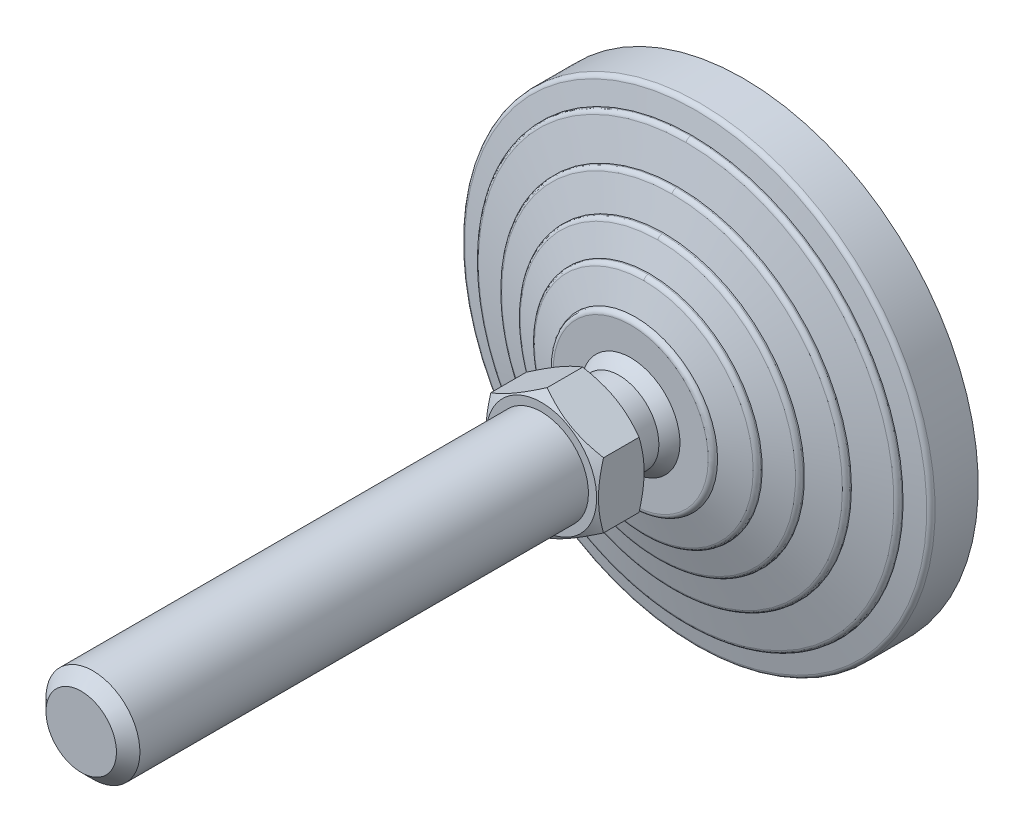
ISO-10303-21;
HEADER;
FILE_DESCRIPTION(('STEP AP214'),'2;1');
FILE_NAME('part.step','',(''),(''),'','','');
FILE_SCHEMA(('AUTOMOTIVE_DESIGN { 1 0 10303 214 1 1 1 1 }'));
ENDSEC;
DATA;
#1=APPLICATION_CONTEXT('core data for automotive mechanical design processes');
#2=APPLICATION_PROTOCOL_DEFINITION('international standard','automotive_design',2000,#1);
#3=PRODUCT_CONTEXT('',#1,'mechanical');
#4=PRODUCT('Part','Part','',(#3));
#5=PRODUCT_RELATED_PRODUCT_CATEGORY('part','',(#4));
#6=PRODUCT_DEFINITION_FORMATION('','',#4);
#7=PRODUCT_DEFINITION_CONTEXT('part definition',#1,'design');
#8=PRODUCT_DEFINITION('design','',#6,#7);
#9=PRODUCT_DEFINITION_SHAPE('','',#8);
#10=(LENGTH_UNIT() NAMED_UNIT(*) SI_UNIT(.MILLI.,.METRE.));
#11=(NAMED_UNIT(*) PLANE_ANGLE_UNIT() SI_UNIT($,.RADIAN.));
#12=(NAMED_UNIT(*) SI_UNIT($,.STERADIAN.) SOLID_ANGLE_UNIT());
#13=UNCERTAINTY_MEASURE_WITH_UNIT(LENGTH_MEASURE(1.E-05),#10,'distance_accuracy_value','');
#14=(GEOMETRIC_REPRESENTATION_CONTEXT(3) GLOBAL_UNCERTAINTY_ASSIGNED_CONTEXT((#13)) GLOBAL_UNIT_ASSIGNED_CONTEXT((#10,
#11,#12)) REPRESENTATION_CONTEXT('',''));
#15=CARTESIAN_POINT('',(0.,0.,0.));
#16=DIRECTION('',(0.,0.,1.));
#17=DIRECTION('',(1.,0.,0.));
#18=AXIS2_PLACEMENT_3D('',#15,#16,#17);
#19=CARTESIAN_POINT('',(-44.173478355,44.022,0.));
#20=DIRECTION('',(0.,0.,1.));
#21=DIRECTION('',(0.,-1.,0.));
#22=AXIS2_PLACEMENT_3D('',#19,#20,#21);
#23=PLANE('',#22);
#24=CARTESIAN_POINT('',(0.,0.,0.));
#25=DIRECTION('',(0.,0.,-1.));
#26=DIRECTION('',(0.,1.,0.));
#27=AXIS2_PLACEMENT_3D('',#24,#25,#26);
#28=CIRCLE('',#27,43.5);
#29=CARTESIAN_POINT('',(0.,43.5,0.));
#30=VERTEX_POINT('',#29);
#31=EDGE_CURVE('E174',#30,#30,#28,.F.);
#32=ORIENTED_EDGE('',*,*,#31,.F.);
#33=EDGE_LOOP('',(#32));
#34=FACE_BOUND('',#33,.T.);
#35=ADVANCED_FACE('F14',(#34),#23,.F.);
#36=CARTESIAN_POINT('',(0.,0.,3.));
#37=DIRECTION('',(0.,0.,-1.));
#38=DIRECTION('',(0.,1.,0.));
#39=AXIS2_PLACEMENT_3D('',#36,#37,#38);
#40=CYLINDRICAL_SURFACE('',#39,43.5);
#41=ORIENTED_EDGE('',*,*,#31,.T.);
#42=EDGE_LOOP('',(#41));
#43=FACE_BOUND('',#42,.T.);
#44=CARTESIAN_POINT('',(0.,0.,3.));
#45=DIRECTION('',(0.,0.,-1.));
#46=DIRECTION('',(0.,1.,0.));
#47=AXIS2_PLACEMENT_3D('',#44,#45,#46);
#48=CIRCLE('',#47,43.5);
#49=CARTESIAN_POINT('',(0.,43.5,3.));
#50=VERTEX_POINT('',#49);
#51=EDGE_CURVE('E172',#50,#50,#48,.T.);
#52=ORIENTED_EDGE('',*,*,#51,.T.);
#53=EDGE_LOOP('',(#52));
#54=FACE_BOUND('',#53,.T.);
#55=ADVANCED_FACE('F326',(#43,#54),#40,.T.);
#56=CARTESIAN_POINT('',(-50.774113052,50.6,3.));
#57=DIRECTION('',(0.,0.,1.));
#58=DIRECTION('',(0.,-1.,0.));
#59=AXIS2_PLACEMENT_3D('',#56,#57,#58);
#60=PLANE('',#59);
#61=ORIENTED_EDGE('',*,*,#51,.F.);
#62=EDGE_LOOP('',(#61));
#63=FACE_BOUND('',#62,.T.);
#64=CARTESIAN_POINT('',(0.,0.,3.));
#65=DIRECTION('',(0.,0.,-1.));
#66=DIRECTION('',(0.,1.,0.));
#67=AXIS2_PLACEMENT_3D('',#64,#65,#66);
#68=CIRCLE('',#67,50.);
#69=CARTESIAN_POINT('',(0.,50.,3.));
#70=VERTEX_POINT('',#69);
#71=EDGE_CURVE('E168',#70,#70,#68,.F.);
#72=ORIENTED_EDGE('',*,*,#71,.F.);
#73=EDGE_LOOP('',(#72));
#74=FACE_BOUND('',#73,.T.);
#75=ADVANCED_FACE('F323',(#63,#74),#60,.F.);
#76=CARTESIAN_POINT('',(0.,0.,12.180196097));
#77=DIRECTION('',(0.,0.,-1.));
#78=DIRECTION('',(0.,1.,0.));
#79=AXIS2_PLACEMENT_3D('',#76,#77,#78);
#80=CYLINDRICAL_SURFACE('',#79,50.);
#81=ORIENTED_EDGE('',*,*,#71,.T.);
#82=EDGE_LOOP('',(#81));
#83=FACE_BOUND('',#82,.T.);
#84=CARTESIAN_POINT('',(0.,0.,12.180196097));
#85=DIRECTION('',(0.,0.,1.));
#86=DIRECTION('',(0.,-1.,0.));
#87=AXIS2_PLACEMENT_3D('',#84,#85,#86);
#88=CIRCLE('',#87,50.);
#89=CARTESIAN_POINT('',(0.,-50.,12.180196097));
#90=VERTEX_POINT('',#89);
#91=EDGE_CURVE('E171',#90,#90,#88,.T.);
#92=ORIENTED_EDGE('',*,*,#91,.F.);
#93=EDGE_LOOP('',(#92));
#94=FACE_BOUND('',#93,.T.);
#95=ADVANCED_FACE('F321',(#83,#94),#80,.T.);
#96=CARTESIAN_POINT('',(0.,0.,12.180196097));
#97=DIRECTION('',(0.,0.,-1.));
#98=DIRECTION('',(0.,1.,0.));
#99=AXIS2_PLACEMENT_3D('',#96,#97,#98);
#100=TOROIDAL_SURFACE('',#99,48.9999999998,1.00000000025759);
#101=ORIENTED_EDGE('',*,*,#91,.T.);
#102=EDGE_LOOP('',(#101));
#103=FACE_BOUND('',#102,.T.);
#104=CARTESIAN_POINT('',(0.,0.,13.160776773));
#105=DIRECTION('',(0.,0.,-1.));
#106=DIRECTION('',(0.,1.,0.));
#107=AXIS2_PLACEMENT_3D('',#104,#105,#106);
#108=CIRCLE('',#107,49.196116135);
#109=CARTESIAN_POINT('',(0.,49.196116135,13.160776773));
#110=VERTEX_POINT('',#109);
#111=EDGE_CURVE('E477',#110,#110,#108,.F.);
#112=ORIENTED_EDGE('',*,*,#111,.F.);
#113=EDGE_LOOP('',(#112));
#114=FACE_BOUND('',#113,.T.);
#115=ADVANCED_FACE('F317',(#103,#114),#100,.T.);
#116=CARTESIAN_POINT('',(0.,0.,14.));
#117=DIRECTION('',(0.,0.,-1.));
#118=DIRECTION('',(1.,0.,0.));
#119=AXIS2_PLACEMENT_3D('',#116,#117,#118);
#120=CONICAL_SURFACE('',#119,45.,1.37340076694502);
#121=ORIENTED_EDGE('',*,*,#111,.T.);
#122=EDGE_LOOP('',(#121));
#123=FACE_BOUND('',#122,.T.);
#124=CARTESIAN_POINT('',(0.,0.,14.));
#125=DIRECTION('',(0.,0.,-1.));
#126=DIRECTION('',(0.,1.,0.));
#127=AXIS2_PLACEMENT_3D('',#124,#125,#126);
#128=CIRCLE('',#127,45.);
#129=CARTESIAN_POINT('',(0.,45.,14.));
#130=VERTEX_POINT('',#129);
#131=EDGE_CURVE('E480',#130,#130,#128,.F.);
#132=ORIENTED_EDGE('',*,*,#131,.F.);
#133=EDGE_LOOP('',(#132));
#134=FACE_BOUND('',#133,.T.);
#135=ADVANCED_FACE('F320',(#123,#134),#120,.T.);
#136=CARTESIAN_POINT('',(0.,0.,14.219223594));
#137=DIRECTION('',(0.,0.,-1.));
#138=DIRECTION('',(1.,0.,0.));
#139=AXIS2_PLACEMENT_3D('',#136,#137,#138);
#140=CYLINDRICAL_SURFACE('',#139,45.);
#141=ORIENTED_EDGE('',*,*,#131,.T.);
#142=EDGE_LOOP('',(#141));
#143=FACE_BOUND('',#142,.T.);
#144=CARTESIAN_POINT('',(0.,0.,14.219223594));
#145=DIRECTION('',(0.,0.,1.));
#146=DIRECTION('',(-1.,0.,0.));
#147=AXIS2_PLACEMENT_3D('',#144,#145,#146);
#148=CIRCLE('',#147,45.);
#149=CARTESIAN_POINT('',(-4.61482714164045E-09,-45.,14.219223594));
#150=VERTEX_POINT('',#149);
#151=CARTESIAN_POINT('',(0.,45.,14.219223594));
#152=VERTEX_POINT('',#151);
#153=EDGE_CURVE('E650',#150,#152,#148,.T.);
#154=ORIENTED_EDGE('',*,*,#153,.F.);
#155=CARTESIAN_POINT('',(0.,0.,14.219223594));
#156=DIRECTION('',(0.,0.,1.));
#157=DIRECTION('',(-1.,0.,0.));
#158=AXIS2_PLACEMENT_3D('',#155,#156,#157);
#159=CIRCLE('',#158,45.);
#160=EDGE_CURVE('E661',#152,#150,#159,.T.);
#161=ORIENTED_EDGE('',*,*,#160,.F.);
#162=EDGE_LOOP('',(#154,#161));
#163=FACE_BOUND('',#162,.T.);
#164=ADVANCED_FACE('F451',(#143,#163),#140,.T.);
#165=CARTESIAN_POINT('',(0.,-45.,14.219223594));
#166=CARTESIAN_POINT('',(-90.0000000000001,-45.,14.219223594));
#167=CARTESIAN_POINT('',(-90.0000000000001,45.,14.219223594));
#168=CARTESIAN_POINT('',(0.,45.,14.219223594));
#169=CARTESIAN_POINT('',(0.,-45.,14.696951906));
#170=CARTESIAN_POINT('',(-90.0000000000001,-45.,14.696951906));
#171=CARTESIAN_POINT('',(-90.0000000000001,45.,14.696951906));
#172=CARTESIAN_POINT('',(0.,45.,14.696951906));
#173=CARTESIAN_POINT('',(0.,-44.706000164,15.073499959));
#174=CARTESIAN_POINT('',(-89.412000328,-44.706000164,15.073499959));
#175=CARTESIAN_POINT('',(-89.412000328,44.706000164,15.073499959));
#176=CARTESIAN_POINT('',(0.,44.706000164,15.073499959));
#177=CARTESIAN_POINT('',(0.,-44.242535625,15.189366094));
#178=CARTESIAN_POINT('',(-88.4850712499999,-44.2425356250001,15.189366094));
#179=CARTESIAN_POINT('',(-88.4850712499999,44.2425356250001,15.189366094));
#180=CARTESIAN_POINT('',(0.,44.242535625,15.189366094));
#181=(BOUNDED_SURFACE() B_SPLINE_SURFACE(3,3,((#165,#166,#167,#168),(#169,#170,#171,#172),(#173,
#174,#175,#176),(#177,#178,#179,#180)),.UNSPECIFIED.,.F.,.F.,
.F.) B_SPLINE_SURFACE_WITH_KNOTS((4,4),(4,4),(0.,1.),(0.,1.),
.UNSPECIFIED.) GEOMETRIC_REPRESENTATION_ITEM() RATIONAL_B_SPLINE_SURFACE(((1.,0.333333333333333,
0.333333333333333,1.),(0.858803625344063,0.286267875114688,0.286267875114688,0.858803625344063),
(0.858803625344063,0.286267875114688,0.286267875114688,0.858803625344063),(1.,0.333333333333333,
0.333333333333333,1.))) REPRESENTATION_ITEM('') SURFACE());
#182=CARTESIAN_POINT('',(0.,45.,14.219223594));
#183=CARTESIAN_POINT('',(0.,45.,14.696951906));
#184=CARTESIAN_POINT('',(0.,44.706000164,15.073499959));
#185=CARTESIAN_POINT('',(0.,44.242535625,15.189366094));
#186=(BOUNDED_CURVE() B_SPLINE_CURVE(3,(#182,#183,#184,#185),.UNSPECIFIED.,.F.,
.F.) B_SPLINE_CURVE_WITH_KNOTS((4,4),(0.,1.),
.UNSPECIFIED.) CURVE() GEOMETRIC_REPRESENTATION_ITEM() RATIONAL_B_SPLINE_CURVE((1.,
0.858803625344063,0.858803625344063,1.)) REPRESENTATION_ITEM(''));
#187=CARTESIAN_POINT('',(0.,44.2425356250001,15.1893660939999));
#188=VERTEX_POINT('',#187);
#189=EDGE_CURVE('E641',#152,#188,#186,.T.);
#190=CARTESIAN_POINT('',(0.,-45.,14.219223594));
#191=CARTESIAN_POINT('',(0.,-45.,14.696951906));
#192=CARTESIAN_POINT('',(0.,-44.706000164,15.073499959));
#193=CARTESIAN_POINT('',(0.,-44.242535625,15.189366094));
#194=(BOUNDED_CURVE() B_SPLINE_CURVE(3,(#190,#191,#192,#193),.UNSPECIFIED.,.F.,
.F.) B_SPLINE_CURVE_WITH_KNOTS((4,4),(0.,1.),
.UNSPECIFIED.) CURVE() GEOMETRIC_REPRESENTATION_ITEM() RATIONAL_B_SPLINE_CURVE((1.,
0.858803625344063,0.858803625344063,1.)) REPRESENTATION_ITEM(''));
#195=CARTESIAN_POINT('',(-1.3611443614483E-08,-44.2425356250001,15.1893660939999));
#196=VERTEX_POINT('',#195);
#197=EDGE_CURVE('E655',#196,#150,#194,.F.);
#198=CARTESIAN_POINT('',(0.,0.,15.1893660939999));
#199=DIRECTION('',(0.,0.,-1.));
#200=DIRECTION('',(0.,1.,0.));
#201=AXIS2_PLACEMENT_3D('',#198,#199,#200);
#202=CIRCLE('',#201,44.242535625);
#203=EDGE_CURVE('E638',#188,#196,#202,.F.);
#204=ORIENTED_EDGE('',*,*,#189,.F.);
#205=ORIENTED_EDGE('',*,*,#160,.T.);
#206=ORIENTED_EDGE('',*,*,#197,.F.);
#207=ORIENTED_EDGE('',*,*,#203,.F.);
#208=EDGE_LOOP('',(#204,#205,#206,#207));
#209=FACE_BOUND('',#208,.T.);
#210=ADVANCED_FACE('F440',(#209),#181,.T.);
#211=CARTESIAN_POINT('',(0.,45.,14.219223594));
#212=CARTESIAN_POINT('',(90.0000000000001,45.,14.219223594));
#213=CARTESIAN_POINT('',(90.0000000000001,-45.,14.219223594));
#214=CARTESIAN_POINT('',(0.,-45.,14.219223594));
#215=CARTESIAN_POINT('',(0.,45.,14.696951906));
#216=CARTESIAN_POINT('',(90.0000000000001,45.,14.696951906));
#217=CARTESIAN_POINT('',(90.0000000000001,-45.,14.696951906));
#218=CARTESIAN_POINT('',(0.,-45.,14.696951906));
#219=CARTESIAN_POINT('',(0.,44.706000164,15.073499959));
#220=CARTESIAN_POINT('',(89.412000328,44.706000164,15.073499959));
#221=CARTESIAN_POINT('',(89.412000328,-44.706000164,15.073499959));
#222=CARTESIAN_POINT('',(0.,-44.706000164,15.073499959));
#223=CARTESIAN_POINT('',(0.,44.242535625,15.189366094));
#224=CARTESIAN_POINT('',(88.4850712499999,44.2425356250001,15.189366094));
#225=CARTESIAN_POINT('',(88.4850712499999,-44.2425356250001,15.189366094));
#226=CARTESIAN_POINT('',(0.,-44.242535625,15.189366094));
#227=(BOUNDED_SURFACE() B_SPLINE_SURFACE(3,3,((#211,#212,#213,#214),(#215,#216,#217,#218),(#219,
#220,#221,#222),(#223,#224,#225,#226)),.UNSPECIFIED.,.F.,.F.,
.F.) B_SPLINE_SURFACE_WITH_KNOTS((4,4),(4,4),(0.,1.),(0.,1.),
.UNSPECIFIED.) GEOMETRIC_REPRESENTATION_ITEM() RATIONAL_B_SPLINE_SURFACE(((1.,0.333333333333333,
0.333333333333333,1.),(0.858803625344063,0.286267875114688,0.286267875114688,0.858803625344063),
(0.858803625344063,0.286267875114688,0.286267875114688,0.858803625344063),(1.,0.333333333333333,
0.333333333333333,1.))) REPRESENTATION_ITEM('') SURFACE());
#228=CARTESIAN_POINT('',(0.,0.,15.1893660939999));
#229=DIRECTION('',(0.,0.,-1.));
#230=DIRECTION('',(0.,1.,0.));
#231=AXIS2_PLACEMENT_3D('',#228,#229,#230);
#232=CIRCLE('',#231,44.242535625);
#233=EDGE_CURVE('E637',#196,#188,#232,.F.);
#234=ORIENTED_EDGE('',*,*,#153,.T.);
#235=ORIENTED_EDGE('',*,*,#189,.T.);
#236=ORIENTED_EDGE('',*,*,#233,.F.);
#237=ORIENTED_EDGE('',*,*,#197,.T.);
#238=EDGE_LOOP('',(#234,#235,#236,#237));
#239=FACE_BOUND('',#238,.T.);
#240=ADVANCED_FACE('F434',(#239),#227,.T.);
#241=CARTESIAN_POINT('',(0.,0.,17.));
#242=DIRECTION('',(0.,0.,-1.));
#243=DIRECTION('',(0.,1.,0.));
#244=AXIS2_PLACEMENT_3D('',#241,#242,#243);
#245=CONICAL_SURFACE('',#244,37.,1.32581766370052);
#246=ORIENTED_EDGE('',*,*,#203,.T.);
#247=ORIENTED_EDGE('',*,*,#233,.T.);
#248=EDGE_LOOP('',(#246,#247));
#249=FACE_BOUND('',#248,.T.);
#250=CARTESIAN_POINT('',(0.,0.,17.));
#251=DIRECTION('',(0.,0.,-1.));
#252=DIRECTION('',(0.,1.,0.));
#253=AXIS2_PLACEMENT_3D('',#250,#251,#252);
#254=CIRCLE('',#253,37.);
#255=CARTESIAN_POINT('',(0.,37.,17.));
#256=VERTEX_POINT('',#255);
#257=EDGE_CURVE('E628',#256,#256,#254,.F.);
#258=ORIENTED_EDGE('',*,*,#257,.F.);
#259=EDGE_LOOP('',(#258));
#260=FACE_BOUND('',#259,.T.);
#261=ADVANCED_FACE('F430',(#249,#260),#245,.T.);
#262=CARTESIAN_POINT('',(0.,0.,17.245698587));
#263=DIRECTION('',(0.,0.,-1.));
#264=DIRECTION('',(1.,0.,0.));
#265=AXIS2_PLACEMENT_3D('',#262,#263,#264);
#266=CYLINDRICAL_SURFACE('',#265,37.);
#267=ORIENTED_EDGE('',*,*,#257,.T.);
#268=EDGE_LOOP('',(#267));
#269=FACE_BOUND('',#268,.T.);
#270=CARTESIAN_POINT('',(0.,0.,17.245698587));
#271=DIRECTION('',(0.,0.,1.));
#272=DIRECTION('',(0.,-1.,0.));
#273=AXIS2_PLACEMENT_3D('',#270,#271,#272);
#274=CIRCLE('',#273,37.);
#275=CARTESIAN_POINT('',(-3.79441342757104E-09,-37.,17.245698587));
#276=VERTEX_POINT('',#275);
#277=CARTESIAN_POINT('',(0.,37.,17.245698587));
#278=VERTEX_POINT('',#277);
#279=EDGE_CURVE('E608',#276,#278,#274,.T.);
#280=ORIENTED_EDGE('',*,*,#279,.F.);
#281=CARTESIAN_POINT('',(0.,0.,17.245698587));
#282=DIRECTION('',(0.,0.,1.));
#283=DIRECTION('',(0.,-1.,0.));
#284=AXIS2_PLACEMENT_3D('',#281,#282,#283);
#285=CIRCLE('',#284,37.);
#286=EDGE_CURVE('E619',#278,#276,#285,.T.);
#287=ORIENTED_EDGE('',*,*,#286,.F.);
#288=EDGE_LOOP('',(#280,#287));
#289=FACE_BOUND('',#288,.T.);
#290=ADVANCED_FACE('F421',(#269,#289),#266,.T.);
#291=CARTESIAN_POINT('',(0.,-37.,17.245698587));
#292=CARTESIAN_POINT('',(-74.,-37.,17.245698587));
#293=CARTESIAN_POINT('',(-74.,37.,17.245698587));
#294=CARTESIAN_POINT('',(0.,37.,17.245698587));
#295=CARTESIAN_POINT('',(0.,-37.,17.709515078));
#296=CARTESIAN_POINT('',(-74.,-37.,17.709515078));
#297=CARTESIAN_POINT('',(-74.,37.,17.709515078));
#298=CARTESIAN_POINT('',(0.,37.,17.709515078));
#299=CARTESIAN_POINT('',(0.,-36.720691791,18.079802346));
#300=CARTESIAN_POINT('',(-73.441383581,-36.720691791,18.079802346));
#301=CARTESIAN_POINT('',(-73.441383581,36.720691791,18.079802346));
#302=CARTESIAN_POINT('',(0.,36.720691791,18.079802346));
#303=CARTESIAN_POINT('',(0.,-36.274721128,18.207222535));
#304=CARTESIAN_POINT('',(-72.549442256,-36.274721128,18.207222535));
#305=CARTESIAN_POINT('',(-72.549442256,36.274721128,18.207222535));
#306=CARTESIAN_POINT('',(0.,36.274721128,18.207222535));
#307=(BOUNDED_SURFACE() B_SPLINE_SURFACE(3,3,((#291,#292,#293,#294),(#295,#296,#297,#298),(#299,
#300,#301,#302),(#303,#304,#305,#306)),.UNSPECIFIED.,.F.,.F.,
.F.) B_SPLINE_SURFACE_WITH_KNOTS((4,4),(4,4),(0.,1.),(0.,1.),
.UNSPECIFIED.) GEOMETRIC_REPRESENTATION_ITEM() RATIONAL_B_SPLINE_SURFACE(((1.,0.333333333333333,
0.333333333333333,1.),(0.865565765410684,0.288521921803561,0.288521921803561,0.865565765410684),
(0.865565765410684,0.288521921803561,0.288521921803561,0.865565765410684),(1.,0.333333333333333,
0.333333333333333,1.))) REPRESENTATION_ITEM('') SURFACE());
#308=CARTESIAN_POINT('',(0.,37.,17.245698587));
#309=CARTESIAN_POINT('',(0.,37.,17.709515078));
#310=CARTESIAN_POINT('',(0.,36.720691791,18.079802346));
#311=CARTESIAN_POINT('',(0.,36.274721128,18.207222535));
#312=(BOUNDED_CURVE() B_SPLINE_CURVE(3,(#308,#309,#310,#311),.UNSPECIFIED.,.F.,
.F.) B_SPLINE_CURVE_WITH_KNOTS((4,4),(0.,1.),
.UNSPECIFIED.) CURVE() GEOMETRIC_REPRESENTATION_ITEM() RATIONAL_B_SPLINE_CURVE((1.,
0.865565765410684,0.865565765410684,1.)) REPRESENTATION_ITEM(''));
#313=CARTESIAN_POINT('',(0.,36.2747211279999,18.207222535));
#314=VERTEX_POINT('',#313);
#315=EDGE_CURVE('E599',#278,#314,#312,.T.);
#316=CARTESIAN_POINT('',(0.,-37.,17.245698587));
#317=CARTESIAN_POINT('',(0.,-37.,17.709515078));
#318=CARTESIAN_POINT('',(0.,-36.720691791,18.079802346));
#319=CARTESIAN_POINT('',(0.,-36.274721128,18.207222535));
#320=(BOUNDED_CURVE() B_SPLINE_CURVE(3,(#316,#317,#318,#319),.UNSPECIFIED.,.F.,
.F.) B_SPLINE_CURVE_WITH_KNOTS((4,4),(0.,1.),
.UNSPECIFIED.) CURVE() GEOMETRIC_REPRESENTATION_ITEM() RATIONAL_B_SPLINE_CURVE((1.,
0.865565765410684,0.865565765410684,1.)) REPRESENTATION_ITEM(''));
#321=CARTESIAN_POINT('',(-1.11601045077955E-08,-36.2747211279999,18.207222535));
#322=VERTEX_POINT('',#321);
#323=EDGE_CURVE('E613',#322,#276,#320,.F.);
#324=CARTESIAN_POINT('',(0.,0.,18.207222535));
#325=DIRECTION('',(0.,0.,-1.));
#326=DIRECTION('',(0.,1.,0.));
#327=AXIS2_PLACEMENT_3D('',#324,#325,#326);
#328=CIRCLE('',#327,36.274721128);
#329=EDGE_CURVE('E596',#314,#322,#328,.F.);
#330=ORIENTED_EDGE('',*,*,#315,.F.);
#331=ORIENTED_EDGE('',*,*,#286,.T.);
#332=ORIENTED_EDGE('',*,*,#323,.F.);
#333=ORIENTED_EDGE('',*,*,#329,.F.);
#334=EDGE_LOOP('',(#330,#331,#332,#333));
#335=FACE_BOUND('',#334,.T.);
#336=ADVANCED_FACE('F410',(#335),#307,.T.);
#337=CARTESIAN_POINT('',(0.,37.,17.245698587));
#338=CARTESIAN_POINT('',(74.,37.,17.245698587));
#339=CARTESIAN_POINT('',(74.,-37.,17.245698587));
#340=CARTESIAN_POINT('',(0.,-37.,17.245698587));
#341=CARTESIAN_POINT('',(0.,37.,17.709515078));
#342=CARTESIAN_POINT('',(74.,37.,17.709515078));
#343=CARTESIAN_POINT('',(74.,-37.,17.709515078));
#344=CARTESIAN_POINT('',(0.,-37.,17.709515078));
#345=CARTESIAN_POINT('',(0.,36.720691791,18.079802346));
#346=CARTESIAN_POINT('',(73.441383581,36.720691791,18.079802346));
#347=CARTESIAN_POINT('',(73.441383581,-36.720691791,18.079802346));
#348=CARTESIAN_POINT('',(0.,-36.720691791,18.079802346));
#349=CARTESIAN_POINT('',(0.,36.274721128,18.207222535));
#350=CARTESIAN_POINT('',(72.549442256,36.274721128,18.207222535));
#351=CARTESIAN_POINT('',(72.549442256,-36.274721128,18.207222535));
#352=CARTESIAN_POINT('',(0.,-36.274721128,18.207222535));
#353=(BOUNDED_SURFACE() B_SPLINE_SURFACE(3,3,((#337,#338,#339,#340),(#341,#342,#343,#344),(#345,
#346,#347,#348),(#349,#350,#351,#352)),.UNSPECIFIED.,.F.,.F.,
.F.) B_SPLINE_SURFACE_WITH_KNOTS((4,4),(4,4),(0.,1.),(0.,1.),
.UNSPECIFIED.) GEOMETRIC_REPRESENTATION_ITEM() RATIONAL_B_SPLINE_SURFACE(((1.,0.333333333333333,
0.333333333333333,1.),(0.865565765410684,0.288521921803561,0.288521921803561,0.865565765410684),
(0.865565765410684,0.288521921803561,0.288521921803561,0.865565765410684),(1.,0.333333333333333,
0.333333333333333,1.))) REPRESENTATION_ITEM('') SURFACE());
#354=CARTESIAN_POINT('',(0.,0.,18.207222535));
#355=DIRECTION('',(0.,0.,-1.));
#356=DIRECTION('',(0.,1.,0.));
#357=AXIS2_PLACEMENT_3D('',#354,#355,#356);
#358=CIRCLE('',#357,36.274721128);
#359=EDGE_CURVE('E595',#322,#314,#358,.F.);
#360=ORIENTED_EDGE('',*,*,#279,.T.);
#361=ORIENTED_EDGE('',*,*,#315,.T.);
#362=ORIENTED_EDGE('',*,*,#359,.F.);
#363=ORIENTED_EDGE('',*,*,#323,.T.);
#364=EDGE_LOOP('',(#360,#361,#362,#363));
#365=FACE_BOUND('',#364,.T.);
#366=ADVANCED_FACE('F404',(#365),#353,.T.);
#367=CARTESIAN_POINT('',(0.,0.,20.));
#368=DIRECTION('',(0.,0.,-1.));
#369=DIRECTION('',(1.,0.,0.));
#370=AXIS2_PLACEMENT_3D('',#367,#368,#369);
#371=CONICAL_SURFACE('',#370,30.,1.29249666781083);
#372=ORIENTED_EDGE('',*,*,#329,.T.);
#373=ORIENTED_EDGE('',*,*,#359,.T.);
#374=EDGE_LOOP('',(#372,#373));
#375=FACE_BOUND('',#374,.T.);
#376=CARTESIAN_POINT('',(0.,0.,20.));
#377=DIRECTION('',(0.,0.,-1.));
#378=DIRECTION('',(0.,1.,0.));
#379=AXIS2_PLACEMENT_3D('',#376,#377,#378);
#380=CIRCLE('',#379,30.);
#381=CARTESIAN_POINT('',(0.,30.,20.));
#382=VERTEX_POINT('',#381);
#383=EDGE_CURVE('E586',#382,#382,#380,.F.);
#384=ORIENTED_EDGE('',*,*,#383,.F.);
#385=EDGE_LOOP('',(#384));
#386=FACE_BOUND('',#385,.T.);
#387=ADVANCED_FACE('F400',(#375,#386),#371,.T.);
#388=CARTESIAN_POINT('',(0.,0.,20.27924078));
#389=DIRECTION('',(0.,0.,-1.));
#390=DIRECTION('',(0.,1.,0.));
#391=AXIS2_PLACEMENT_3D('',#388,#389,#390);
#392=CYLINDRICAL_SURFACE('',#391,30.);
#393=ORIENTED_EDGE('',*,*,#383,.T.);
#394=EDGE_LOOP('',(#393));
#395=FACE_BOUND('',#394,.T.);
#396=CARTESIAN_POINT('',(0.,0.,20.27924078));
#397=DIRECTION('',(0.,0.,1.));
#398=DIRECTION('',(0.,-1.,0.));
#399=AXIS2_PLACEMENT_3D('',#396,#397,#398);
#400=CIRCLE('',#399,30.);
#401=CARTESIAN_POINT('',(-3.0765514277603E-09,-30.,20.27924078));
#402=VERTEX_POINT('',#401);
#403=CARTESIAN_POINT('',(0.,30.,20.27924078));
#404=VERTEX_POINT('',#403);
#405=EDGE_CURVE('E566',#402,#404,#400,.T.);
#406=ORIENTED_EDGE('',*,*,#405,.F.);
#407=CARTESIAN_POINT('',(0.,0.,20.27924078));
#408=DIRECTION('',(0.,0.,1.));
#409=DIRECTION('',(0.,-1.,0.));
#410=AXIS2_PLACEMENT_3D('',#407,#408,#409);
#411=CIRCLE('',#410,30.);
#412=EDGE_CURVE('E577',#404,#402,#411,.T.);
#413=ORIENTED_EDGE('',*,*,#412,.F.);
#414=EDGE_LOOP('',(#406,#413));
#415=FACE_BOUND('',#414,.T.);
#416=ADVANCED_FACE('F391',(#395,#415),#392,.T.);
#417=CARTESIAN_POINT('',(0.,-30.,20.27924078));
#418=CARTESIAN_POINT('',(-60.0000000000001,-30.,20.27924078));
#419=CARTESIAN_POINT('',(-60.0000000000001,30.,20.27924078));
#420=CARTESIAN_POINT('',(0.,30.,20.27924078));
#421=CARTESIAN_POINT('',(0.,-30.,20.725161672));
#422=CARTESIAN_POINT('',(-60.,-30.,20.725161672));
#423=CARTESIAN_POINT('',(-60.,30.,20.725161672));
#424=CARTESIAN_POINT('',(0.,30.,20.725161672));
#425=CARTESIAN_POINT('',(0.,-29.739265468,21.086911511));
#426=CARTESIAN_POINT('',(-59.478530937,-29.739265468,21.086911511));
#427=CARTESIAN_POINT('',(-59.478530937,29.739265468,21.086911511));
#428=CARTESIAN_POINT('',(0.,29.739265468,21.086911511));
#429=CARTESIAN_POINT('',(0.,-29.316227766,21.227924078));
#430=CARTESIAN_POINT('',(-58.6324555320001,-29.316227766,21.227924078));
#431=CARTESIAN_POINT('',(-58.6324555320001,29.316227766,21.227924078));
#432=CARTESIAN_POINT('',(0.,29.316227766,21.227924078));
#433=(BOUNDED_SURFACE() B_SPLINE_SURFACE(3,3,((#417,#418,#419,#420),(#421,#422,#423,#424),(#425,
#426,#427,#428),(#429,#430,#431,#432)),.UNSPECIFIED.,.F.,.F.,
.F.) B_SPLINE_SURFACE_WITH_KNOTS((4,4),(4,4),(0.,1.),(0.,1.),
.UNSPECIFIED.) GEOMETRIC_REPRESENTATION_ITEM() RATIONAL_B_SPLINE_SURFACE(((1.,0.333333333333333,
0.333333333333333,1.),(0.874161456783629,0.29138715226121,0.29138715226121,0.874161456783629),
(0.874161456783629,0.29138715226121,0.29138715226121,0.874161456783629),(1.,0.333333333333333,
0.333333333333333,1.))) REPRESENTATION_ITEM('') SURFACE());
#434=CARTESIAN_POINT('',(0.,30.,20.27924078));
#435=CARTESIAN_POINT('',(0.,30.,20.725161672));
#436=CARTESIAN_POINT('',(0.,29.739265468,21.086911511));
#437=CARTESIAN_POINT('',(0.,29.316227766,21.227924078));
#438=(BOUNDED_CURVE() B_SPLINE_CURVE(3,(#434,#435,#436,#437),.UNSPECIFIED.,.F.,
.F.) B_SPLINE_CURVE_WITH_KNOTS((4,4),(0.,1.),
.UNSPECIFIED.) CURVE() GEOMETRIC_REPRESENTATION_ITEM() RATIONAL_B_SPLINE_CURVE((1.,
0.874161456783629,0.874161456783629,1.)) REPRESENTATION_ITEM(''));
#439=CARTESIAN_POINT('',(0.,29.316227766,21.227924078));
#440=VERTEX_POINT('',#439);
#441=EDGE_CURVE('E557',#404,#440,#438,.T.);
#442=CARTESIAN_POINT('',(0.,-30.,20.27924078));
#443=CARTESIAN_POINT('',(0.,-30.,20.725161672));
#444=CARTESIAN_POINT('',(0.,-29.739265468,21.086911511));
#445=CARTESIAN_POINT('',(0.,-29.316227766,21.227924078));
#446=(BOUNDED_CURVE() B_SPLINE_CURVE(3,(#442,#443,#444,#445),.UNSPECIFIED.,.F.,
.F.) B_SPLINE_CURVE_WITH_KNOTS((4,4),(0.,1.),
.UNSPECIFIED.) CURVE() GEOMETRIC_REPRESENTATION_ITEM() RATIONAL_B_SPLINE_CURVE((1.,
0.874161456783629,0.874161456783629,1.)) REPRESENTATION_ITEM(''));
#447=CARTESIAN_POINT('',(-9.01928823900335E-09,-29.316227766,21.227924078));
#448=VERTEX_POINT('',#447);
#449=EDGE_CURVE('E571',#448,#402,#446,.F.);
#450=CARTESIAN_POINT('',(0.,0.,21.227924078));
#451=DIRECTION('',(0.,0.,-1.));
#452=DIRECTION('',(0.,1.,0.));
#453=AXIS2_PLACEMENT_3D('',#450,#451,#452);
#454=CIRCLE('',#453,29.316227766);
#455=EDGE_CURVE('E554',#440,#448,#454,.F.);
#456=ORIENTED_EDGE('',*,*,#441,.F.);
#457=ORIENTED_EDGE('',*,*,#412,.T.);
#458=ORIENTED_EDGE('',*,*,#449,.F.);
#459=ORIENTED_EDGE('',*,*,#455,.F.);
#460=EDGE_LOOP('',(#456,#457,#458,#459));
#461=FACE_BOUND('',#460,.T.);
#462=ADVANCED_FACE('F380',(#461),#433,.T.);
#463=CARTESIAN_POINT('',(0.,30.,20.27924078));
#464=CARTESIAN_POINT('',(60.0000000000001,30.,20.27924078));
#465=CARTESIAN_POINT('',(60.0000000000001,-30.,20.27924078));
#466=CARTESIAN_POINT('',(0.,-30.,20.27924078));
#467=CARTESIAN_POINT('',(0.,30.,20.725161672));
#468=CARTESIAN_POINT('',(60.,30.,20.725161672));
#469=CARTESIAN_POINT('',(60.,-30.,20.725161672));
#470=CARTESIAN_POINT('',(0.,-30.,20.725161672));
#471=CARTESIAN_POINT('',(0.,29.739265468,21.086911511));
#472=CARTESIAN_POINT('',(59.478530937,29.739265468,21.086911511));
#473=CARTESIAN_POINT('',(59.478530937,-29.739265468,21.086911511));
#474=CARTESIAN_POINT('',(0.,-29.739265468,21.086911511));
#475=CARTESIAN_POINT('',(0.,29.316227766,21.227924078));
#476=CARTESIAN_POINT('',(58.6324555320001,29.316227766,21.227924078));
#477=CARTESIAN_POINT('',(58.6324555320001,-29.316227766,21.227924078));
#478=CARTESIAN_POINT('',(0.,-29.316227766,21.227924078));
#479=(BOUNDED_SURFACE() B_SPLINE_SURFACE(3,3,((#463,#464,#465,#466),(#467,#468,#469,#470),(#471,
#472,#473,#474),(#475,#476,#477,#478)),.UNSPECIFIED.,.F.,.F.,
.F.) B_SPLINE_SURFACE_WITH_KNOTS((4,4),(4,4),(0.,1.),(0.,1.),
.UNSPECIFIED.) GEOMETRIC_REPRESENTATION_ITEM() RATIONAL_B_SPLINE_SURFACE(((1.,0.333333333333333,
0.333333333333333,1.),(0.874161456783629,0.29138715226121,0.29138715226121,0.874161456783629),
(0.874161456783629,0.29138715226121,0.29138715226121,0.874161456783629),(1.,0.333333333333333,
0.333333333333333,1.))) REPRESENTATION_ITEM('') SURFACE());
#480=CARTESIAN_POINT('',(0.,0.,21.227924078));
#481=DIRECTION('',(0.,0.,-1.));
#482=DIRECTION('',(0.,1.,0.));
#483=AXIS2_PLACEMENT_3D('',#480,#481,#482);
#484=CIRCLE('',#483,29.316227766);
#485=EDGE_CURVE('E553',#448,#440,#484,.F.);
#486=ORIENTED_EDGE('',*,*,#405,.T.);
#487=ORIENTED_EDGE('',*,*,#441,.T.);
#488=ORIENTED_EDGE('',*,*,#485,.F.);
#489=ORIENTED_EDGE('',*,*,#449,.T.);
#490=EDGE_LOOP('',(#486,#487,#488,#489));
#491=FACE_BOUND('',#490,.T.);
#492=ADVANCED_FACE('F374',(#491),#479,.T.);
#493=CARTESIAN_POINT('',(0.,0.,23.));
#494=DIRECTION('',(0.,0.,-1.));
#495=DIRECTION('',(0.,1.,0.));
#496=AXIS2_PLACEMENT_3D('',#493,#494,#495);
#497=CONICAL_SURFACE('',#496,24.,1.24904577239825);
#498=ORIENTED_EDGE('',*,*,#455,.T.);
#499=ORIENTED_EDGE('',*,*,#485,.T.);
#500=EDGE_LOOP('',(#498,#499));
#501=FACE_BOUND('',#500,.T.);
#502=CARTESIAN_POINT('',(0.,0.,23.));
#503=DIRECTION('',(0.,0.,-1.));
#504=DIRECTION('',(0.,1.,0.));
#505=AXIS2_PLACEMENT_3D('',#502,#503,#504);
#506=CIRCLE('',#505,24.);
#507=CARTESIAN_POINT('',(0.,24.,23.));
#508=VERTEX_POINT('',#507);
#509=EDGE_CURVE('E544',#508,#508,#506,.F.);
#510=ORIENTED_EDGE('',*,*,#509,.F.);
#511=EDGE_LOOP('',(#510));
#512=FACE_BOUND('',#511,.T.);
#513=ADVANCED_FACE('F370',(#501,#512),#497,.T.);
#514=CARTESIAN_POINT('',(0.,0.,23.261425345));
#515=DIRECTION('',(0.,0.,-1.));
#516=DIRECTION('',(0.,1.,0.));
#517=AXIS2_PLACEMENT_3D('',#514,#515,#516);
#518=CYLINDRICAL_SURFACE('',#517,24.);
#519=ORIENTED_EDGE('',*,*,#509,.T.);
#520=EDGE_LOOP('',(#519));
#521=FACE_BOUND('',#520,.T.);
#522=CARTESIAN_POINT('',(0.,0.,23.261425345));
#523=DIRECTION('',(0.,0.,1.));
#524=DIRECTION('',(0.,-1.,0.));
#525=AXIS2_PLACEMENT_3D('',#522,#523,#524);
#526=CIRCLE('',#525,24.);
#527=CARTESIAN_POINT('',(-2.46124114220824E-09,-24.,23.261425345));
#528=VERTEX_POINT('',#527);
#529=CARTESIAN_POINT('',(0.,24.,23.261425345));
#530=VERTEX_POINT('',#529);
#531=EDGE_CURVE('E524',#528,#530,#526,.T.);
#532=ORIENTED_EDGE('',*,*,#531,.F.);
#533=CARTESIAN_POINT('',(0.,0.,23.261425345));
#534=DIRECTION('',(0.,0.,1.));
#535=DIRECTION('',(0.,-1.,0.));
#536=AXIS2_PLACEMENT_3D('',#533,#534,#535);
#537=CIRCLE('',#536,24.);
#538=EDGE_CURVE('E535',#530,#528,#537,.T.);
#539=ORIENTED_EDGE('',*,*,#538,.F.);
#540=EDGE_LOOP('',(#532,#539));
#541=FACE_BOUND('',#540,.T.);
#542=ADVANCED_FACE('F361',(#521,#541),#518,.T.);
#543=CARTESIAN_POINT('',(0.,-24.,23.261425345));
#544=CARTESIAN_POINT('',(-48.,-24.,23.261425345));
#545=CARTESIAN_POINT('',(-48.,24.,23.261425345));
#546=CARTESIAN_POINT('',(0.,24.,23.261425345));
#547=CARTESIAN_POINT('',(0.,-24.,23.716888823));
#548=CARTESIAN_POINT('',(-48.,-24.,23.716888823));
#549=CARTESIAN_POINT('',(-48.,24.,23.716888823));
#550=CARTESIAN_POINT('',(0.,24.,23.716888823));
#551=CARTESIAN_POINT('',(0.,-23.72940828,24.083258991));
#552=CARTESIAN_POINT('',(-47.458816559,-23.72940828,24.083258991));
#553=CARTESIAN_POINT('',(-47.458816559,23.72940828,24.083258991));
#554=CARTESIAN_POINT('',(0.,23.72940828,24.083258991));
#555=CARTESIAN_POINT('',(0.,-23.294085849,24.217204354));
#556=CARTESIAN_POINT('',(-46.5881716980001,-23.294085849,24.217204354));
#557=CARTESIAN_POINT('',(-46.5881716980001,23.294085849,24.217204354));
#558=CARTESIAN_POINT('',(0.,23.294085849,24.217204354));
#559=(BOUNDED_SURFACE() B_SPLINE_SURFACE(3,3,((#543,#544,#545,#546),(#547,#548,#549,#550),(#551,
#552,#553,#554),(#555,#556,#557,#558)),.UNSPECIFIED.,.F.,.F.,
.F.) B_SPLINE_SURFACE_WITH_KNOTS((4,4),(4,4),(0.,1.),(0.,1.),
.UNSPECIFIED.) GEOMETRIC_REPRESENTATION_ITEM() RATIONAL_B_SPLINE_SURFACE(((1.,0.333333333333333,
0.333333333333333,1.),(0.869593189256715,0.289864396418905,0.289864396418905,0.869593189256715),
(0.869593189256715,0.289864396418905,0.289864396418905,0.869593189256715),(1.,0.333333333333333,
0.333333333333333,1.))) REPRESENTATION_ITEM('') SURFACE());
#560=CARTESIAN_POINT('',(0.,24.,23.261425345));
#561=CARTESIAN_POINT('',(0.,24.,23.716888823));
#562=CARTESIAN_POINT('',(0.,23.72940828,24.083258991));
#563=CARTESIAN_POINT('',(0.,23.294085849,24.217204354));
#564=(BOUNDED_CURVE() B_SPLINE_CURVE(3,(#560,#561,#562,#563),.UNSPECIFIED.,.F.,
.F.) B_SPLINE_CURVE_WITH_KNOTS((4,4),(0.,1.),
.UNSPECIFIED.) CURVE() GEOMETRIC_REPRESENTATION_ITEM() RATIONAL_B_SPLINE_CURVE((1.,
0.869593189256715,0.869593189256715,1.)) REPRESENTATION_ITEM(''));
#565=CARTESIAN_POINT('',(0.,23.2940858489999,24.2172043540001));
#566=VERTEX_POINT('',#565);
#567=EDGE_CURVE('E515',#530,#566,#564,.T.);
#568=CARTESIAN_POINT('',(0.,-24.,23.261425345));
#569=CARTESIAN_POINT('',(0.,-24.,23.716888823));
#570=CARTESIAN_POINT('',(0.,-23.72940828,24.083258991));
#571=CARTESIAN_POINT('',(0.,-23.294085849,24.217204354));
#572=(BOUNDED_CURVE() B_SPLINE_CURVE(3,(#568,#569,#570,#571),.UNSPECIFIED.,.F.,
.F.) B_SPLINE_CURVE_WITH_KNOTS((4,4),(0.,1.),
.UNSPECIFIED.) CURVE() GEOMETRIC_REPRESENTATION_ITEM() RATIONAL_B_SPLINE_CURVE((1.,
0.869593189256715,0.869593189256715,1.)) REPRESENTATION_ITEM(''));
#573=CARTESIAN_POINT('',(-7.16654530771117E-09,-23.2940858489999,24.2172043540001));
#574=VERTEX_POINT('',#573);
#575=EDGE_CURVE('E529',#574,#528,#572,.F.);
#576=CARTESIAN_POINT('',(0.,0.,24.2172043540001));
#577=DIRECTION('',(0.,0.,-1.));
#578=DIRECTION('',(0.,1.,0.));
#579=AXIS2_PLACEMENT_3D('',#576,#577,#578);
#580=CIRCLE('',#579,23.294085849);
#581=EDGE_CURVE('E512',#566,#574,#580,.F.);
#582=ORIENTED_EDGE('',*,*,#567,.F.);
#583=ORIENTED_EDGE('',*,*,#538,.T.);
#584=ORIENTED_EDGE('',*,*,#575,.F.);
#585=ORIENTED_EDGE('',*,*,#581,.F.);
#586=EDGE_LOOP('',(#582,#583,#584,#585));
#587=FACE_BOUND('',#586,.T.);
#588=ADVANCED_FACE('F350',(#587),#559,.T.);
#589=CARTESIAN_POINT('',(0.,24.,23.261425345));
#590=CARTESIAN_POINT('',(48.,24.,23.261425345));
#591=CARTESIAN_POINT('',(48.,-24.,23.261425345));
#592=CARTESIAN_POINT('',(0.,-24.,23.261425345));
#593=CARTESIAN_POINT('',(0.,24.,23.716888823));
#594=CARTESIAN_POINT('',(48.,24.,23.716888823));
#595=CARTESIAN_POINT('',(48.,-24.,23.716888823));
#596=CARTESIAN_POINT('',(0.,-24.,23.716888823));
#597=CARTESIAN_POINT('',(0.,23.72940828,24.083258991));
#598=CARTESIAN_POINT('',(47.458816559,23.72940828,24.083258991));
#599=CARTESIAN_POINT('',(47.458816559,-23.72940828,24.083258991));
#600=CARTESIAN_POINT('',(0.,-23.72940828,24.083258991));
#601=CARTESIAN_POINT('',(0.,23.294085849,24.217204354));
#602=CARTESIAN_POINT('',(46.5881716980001,23.294085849,24.217204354));
#603=CARTESIAN_POINT('',(46.5881716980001,-23.294085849,24.217204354));
#604=CARTESIAN_POINT('',(0.,-23.294085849,24.217204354));
#605=(BOUNDED_SURFACE() B_SPLINE_SURFACE(3,3,((#589,#590,#591,#592),(#593,#594,#595,#596),(#597,
#598,#599,#600),(#601,#602,#603,#604)),.UNSPECIFIED.,.F.,.F.,
.F.) B_SPLINE_SURFACE_WITH_KNOTS((4,4),(4,4),(0.,1.),(0.,1.),
.UNSPECIFIED.) GEOMETRIC_REPRESENTATION_ITEM() RATIONAL_B_SPLINE_SURFACE(((1.,0.333333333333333,
0.333333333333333,1.),(0.869593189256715,0.289864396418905,0.289864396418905,0.869593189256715),
(0.869593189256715,0.289864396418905,0.289864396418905,0.869593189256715),(1.,0.333333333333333,
0.333333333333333,1.))) REPRESENTATION_ITEM('') SURFACE());
#606=CARTESIAN_POINT('',(0.,0.,24.2172043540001));
#607=DIRECTION('',(0.,0.,-1.));
#608=DIRECTION('',(0.,1.,0.));
#609=AXIS2_PLACEMENT_3D('',#606,#607,#608);
#610=CIRCLE('',#609,23.294085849);
#611=EDGE_CURVE('E511',#574,#566,#610,.F.);
#612=ORIENTED_EDGE('',*,*,#531,.T.);
#613=ORIENTED_EDGE('',*,*,#567,.T.);
#614=ORIENTED_EDGE('',*,*,#611,.F.);
#615=ORIENTED_EDGE('',*,*,#575,.T.);
#616=EDGE_LOOP('',(#612,#613,#614,#615));
#617=FACE_BOUND('',#616,.T.);
#618=ADVANCED_FACE('F344',(#617),#605,.T.);
#619=CARTESIAN_POINT('',(0.,0.,26.));
#620=DIRECTION('',(0.,0.,-1.));
#621=DIRECTION('',(1.,0.,0.));
#622=AXIS2_PLACEMENT_3D('',#619,#620,#621);
#623=CONICAL_SURFACE('',#622,17.5,1.27229739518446);
#624=ORIENTED_EDGE('',*,*,#581,.T.);
#625=ORIENTED_EDGE('',*,*,#611,.T.);
#626=EDGE_LOOP('',(#624,#625));
#627=FACE_BOUND('',#626,.T.);
#628=CARTESIAN_POINT('',(0.,0.,26.));
#629=DIRECTION('',(0.,0.,1.));
#630=DIRECTION('',(0.,-1.,0.));
#631=AXIS2_PLACEMENT_3D('',#628,#629,#630);
#632=CIRCLE('',#631,17.5);
#633=CARTESIAN_POINT('',(0.,-17.5,26.));
#634=VERTEX_POINT('',#633);
#635=EDGE_CURVE('E167',#634,#634,#632,.T.);
#636=ORIENTED_EDGE('',*,*,#635,.F.);
#637=EDGE_LOOP('',(#636));
#638=FACE_BOUND('',#637,.T.);
#639=ADVANCED_FACE('F315',(#627,#638),#623,.T.);
#640=CARTESIAN_POINT('',(0.,0.,26.));
#641=DIRECTION('',(0.,0.,-1.));
#642=DIRECTION('',(0.,1.,0.));
#643=AXIS2_PLACEMENT_3D('',#640,#641,#642);
#644=TOROIDAL_SURFACE('',#643,16.5,1.);
#645=ORIENTED_EDGE('',*,*,#635,.T.);
#646=EDGE_LOOP('',(#645));
#647=FACE_BOUND('',#646,.T.);
#648=CARTESIAN_POINT('',(0.,0.,27.));
#649=DIRECTION('',(0.,0.,-1.));
#650=DIRECTION('',(0.,1.,0.));
#651=AXIS2_PLACEMENT_3D('',#648,#649,#650);
#652=CIRCLE('',#651,16.499999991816);
#653=CARTESIAN_POINT('',(0.,16.499999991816,27.));
#654=VERTEX_POINT('',#653);
#655=EDGE_CURVE('E164',#654,#654,#652,.T.);
#656=ORIENTED_EDGE('',*,*,#655,.T.);
#657=EDGE_LOOP('',(#656));
#658=FACE_BOUND('',#657,.T.);
#659=ADVANCED_FACE('F311',(#647,#658),#644,.T.);
#660=CARTESIAN_POINT('',(-16.755457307,-16.698,27.));
#661=DIRECTION('',(0.,0.,-1.));
#662=DIRECTION('',(0.,1.,0.));
#663=AXIS2_PLACEMENT_3D('',#660,#661,#662);
#664=PLANE('',#663);
#665=CARTESIAN_POINT('',(0.,0.,27.));
#666=DIRECTION('',(0.,0.,-1.));
#667=DIRECTION('',(0.,1.,0.));
#668=AXIS2_PLACEMENT_3D('',#665,#666,#667);
#669=CIRCLE('',#668,10.4879440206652);
#670=CARTESIAN_POINT('',(0.,10.4879440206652,27.));
#671=VERTEX_POINT('',#670);
#672=EDGE_CURVE('E161',#671,#671,#669,.F.);
#673=ORIENTED_EDGE('',*,*,#672,.F.);
#674=EDGE_LOOP('',(#673));
#675=FACE_BOUND('',#674,.T.);
#676=ORIENTED_EDGE('',*,*,#655,.F.);
#677=EDGE_LOOP('',(#676));
#678=FACE_BOUND('',#677,.T.);
#679=ADVANCED_FACE('F308',(#675,#678),#664,.F.);
#680=CARTESIAN_POINT('',(0.,0.,20.670266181));
#681=DIRECTION('',(0.,0.,-1.));
#682=DIRECTION('',(1.,0.,0.));
#683=AXIS2_PLACEMENT_3D('',#680,#681,#682);
#684=SPHERICAL_SURFACE('',#683,12.25);
#685=ORIENTED_EDGE('',*,*,#672,.T.);
#686=EDGE_LOOP('',(#685));
#687=FACE_BOUND('',#686,.T.);
#688=CARTESIAN_POINT('',(0.,0.,29.5));
#689=DIRECTION('',(0.,0.,-1.));
#690=DIRECTION('',(0.,1.,0.));
#691=AXIS2_PLACEMENT_3D('',#688,#689,#690);
#692=CIRCLE('',#691,8.49107182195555);
#693=CARTESIAN_POINT('',(0.,8.49107182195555,29.5));
#694=VERTEX_POINT('',#693);
#695=EDGE_CURVE('E158',#694,#694,#692,.T.);
#696=ORIENTED_EDGE('',*,*,#695,.T.);
#697=EDGE_LOOP('',(#696));
#698=FACE_BOUND('',#697,.T.);
#699=ADVANCED_FACE('F306',(#687,#698),#684,.T.);
#700=CARTESIAN_POINT('',(-8.631599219,8.622532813,29.5));
#701=DIRECTION('',(0.,0.,1.));
#702=DIRECTION('',(0.,-1.,0.));
#703=AXIS2_PLACEMENT_3D('',#700,#701,#702);
#704=PLANE('',#703);
#705=ORIENTED_EDGE('',*,*,#695,.F.);
#706=EDGE_LOOP('',(#705));
#707=FACE_BOUND('',#706,.T.);
#708=CARTESIAN_POINT('',(0.,0.,29.5));
#709=DIRECTION('',(0.,0.,-1.));
#710=DIRECTION('',(0.,1.,0.));
#711=AXIS2_PLACEMENT_3D('',#708,#709,#710);
#712=CIRCLE('',#711,8.5);
#713=CARTESIAN_POINT('',(0.,8.5,29.5));
#714=VERTEX_POINT('',#713);
#715=EDGE_CURVE('E155',#714,#714,#712,.F.);
#716=ORIENTED_EDGE('',*,*,#715,.F.);
#717=EDGE_LOOP('',(#716));
#718=FACE_BOUND('',#717,.T.);
#719=ADVANCED_FACE('F298',(#707,#718),#704,.F.);
#720=CARTESIAN_POINT('',(0.,0.,36.));
#721=DIRECTION('',(0.,0.,-1.));
#722=DIRECTION('',(0.,1.,0.));
#723=AXIS2_PLACEMENT_3D('',#720,#721,#722);
#724=CYLINDRICAL_SURFACE('',#723,8.5);
#725=ORIENTED_EDGE('',*,*,#715,.T.);
#726=EDGE_LOOP('',(#725));
#727=FACE_BOUND('',#726,.T.);
#728=CARTESIAN_POINT('',(0.,0.,36.));
#729=DIRECTION('',(0.,0.,-1.));
#730=DIRECTION('',(0.,1.,0.));
#731=AXIS2_PLACEMENT_3D('',#728,#729,#730);
#732=CIRCLE('',#731,8.5);
#733=CARTESIAN_POINT('',(0.,8.5,36.));
#734=VERTEX_POINT('',#733);
#735=EDGE_CURVE('E152',#734,#734,#732,.T.);
#736=ORIENTED_EDGE('',*,*,#735,.T.);
#737=EDGE_LOOP('',(#736));
#738=FACE_BOUND('',#737,.T.);
#739=ADVANCED_FACE('F292',(#727,#738),#724,.T.);
#740=CARTESIAN_POINT('',(-12.,14.022683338,36.));
#741=DIRECTION('',(0.,0.,1.));
#742=DIRECTION('',(0.,-1.,0.));
#743=AXIS2_PLACEMENT_3D('',#740,#741,#742);
#744=PLANE('',#743);
#745=CARTESIAN_POINT('',(0.,0.,36.));
#746=DIRECTION('',(0.,0.,-1.));
#747=DIRECTION('',(-1.,0.,0.));
#748=AXIS2_PLACEMENT_3D('',#745,#746,#747);
#749=CIRCLE('',#748,11.75);
#750=CARTESIAN_POINT('',(-11.75,0.,36.));
#751=VERTEX_POINT('',#750);
#752=EDGE_CURVE('E497',#751,#751,#749,.T.);
#753=ORIENTED_EDGE('',*,*,#752,.T.);
#754=EDGE_LOOP('',(#753));
#755=FACE_BOUND('',#754,.T.);
#756=ORIENTED_EDGE('',*,*,#735,.F.);
#757=EDGE_LOOP('',(#756));
#758=FACE_BOUND('',#757,.T.);
#759=ADVANCED_FACE('F223',(#755,#758),#744,.F.);
#760=CARTESIAN_POINT('',(0.,0.,38.7004038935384));
#761=DIRECTION('',(0.,0.,1.));
#762=DIRECTION('',(1.,0.,0.));
#763=AXIS2_PLACEMENT_3D('',#760,#761,#762);
#764=CONICAL_SURFACE('',#763,16.4272367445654,1.0471975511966);
#765=CARTESIAN_POINT('',(-12.,-18.5611191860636,41.9769486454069));
#766=CARTESIAN_POINT('',(-12.,-18.2992746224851,41.8499966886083));
#767=CARTESIAN_POINT('',(-12.,-18.0371214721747,41.723681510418));
#768=CARTESIAN_POINT('',(-12.,-17.5121335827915,41.4724690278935));
#769=CARTESIAN_POINT('',(-12.,-17.2492988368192,41.3475717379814));
#770=CARTESIAN_POINT('',(-12.,-16.4596049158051,40.9751899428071));
#771=CARTESIAN_POINT('',(-12.,-15.9316342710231,40.7300535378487));
#772=CARTESIAN_POINT('',(-12.,-14.8692466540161,40.2462037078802));
#773=CARTESIAN_POINT('',(-12.,-14.3348102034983,40.0075329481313));
#774=CARTESIAN_POINT('',(-12.,-13.2616700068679,39.5400202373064));
#775=CARTESIAN_POINT('',(-12.,-12.7229664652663,39.3111778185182));
#776=CARTESIAN_POINT('',(-12.,-11.6232302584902,38.858847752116));
#777=CARTESIAN_POINT('',(-12.,-11.0620318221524,38.6357610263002));
#778=CARTESIAN_POINT('',(-12.,-9.93304724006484,38.2065895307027));
#779=CARTESIAN_POINT('',(-12.,-9.36526036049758,38.0005066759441));
#780=CARTESIAN_POINT('',(-12.,-8.22329291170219,37.6107919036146));
#781=CARTESIAN_POINT('',(-12.,-7.64912812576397,37.4271141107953));
#782=CARTESIAN_POINT('',(-12.,-6.49250808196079,37.0881256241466));
#783=CARTESIAN_POINT('',(-12.,-5.91005551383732,36.9328059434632));
#784=CARTESIAN_POINT('',(-12.,-5.03167267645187,36.7271635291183));
#785=CARTESIAN_POINT('',(-12.,-4.73889103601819,36.6633081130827));
#786=CARTESIAN_POINT('',(-12.,-4.151336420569,36.5454750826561));
#787=CARTESIAN_POINT('',(-12.,-3.85656348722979,36.4914972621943));
#788=CARTESIAN_POINT('',(-12.,-3.26523274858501,36.394375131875));
#789=CARTESIAN_POINT('',(-12.,-2.96867496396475,36.3512306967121));
#790=CARTESIAN_POINT('',(-12.,-2.37409322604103,36.2766379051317));
#791=CARTESIAN_POINT('',(-12.,-2.07606932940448,36.2451891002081));
#792=CARTESIAN_POINT('',(-12.,-1.48284131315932,36.1950038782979));
#793=CARTESIAN_POINT('',(-12.,-1.18765078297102,36.1761078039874));
#794=CARTESIAN_POINT('',(-12.,-0.596735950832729,36.1508125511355));
#795=CARTESIAN_POINT('',(-12.,-0.30101165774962,36.1444131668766));
#796=CARTESIAN_POINT('',(-12.,0.290443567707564,36.1442633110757));
#797=CARTESIAN_POINT('',(-12.,0.586174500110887,36.1505129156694));
#798=CARTESIAN_POINT('',(-12.,1.17711127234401,36.1755094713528));
#799=CARTESIAN_POINT('',(-12.,1.47231708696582,36.1942570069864));
#800=CARTESIAN_POINT('',(-12.,2.1832784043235,36.2540622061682));
#801=CARTESIAN_POINT('',(-12.,2.59853692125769,36.3011323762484));
#802=CARTESIAN_POINT('',(-12.,3.42594216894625,36.417427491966));
#803=CARTESIAN_POINT('',(-12.,3.83808846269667,36.4866554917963));
#804=CARTESIAN_POINT('',(-12.,4.65888671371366,36.6448034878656));
#805=CARTESIAN_POINT('',(-12.,5.06753565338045,36.7337389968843));
#806=CARTESIAN_POINT('',(-12.,5.88071965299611,36.9285908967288));
#807=CARTESIAN_POINT('',(-12.,6.28525477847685,37.0345070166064));
#808=CARTESIAN_POINT('',(-12.,7.09907141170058,37.2632391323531));
#809=CARTESIAN_POINT('',(-12.,7.50826244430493,37.3863748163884));
#810=CARTESIAN_POINT('',(-12.,8.32261298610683,37.6452574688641));
#811=CARTESIAN_POINT('',(-12.,8.72777246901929,37.7810045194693));
#812=CARTESIAN_POINT('',(-12.,9.53426203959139,38.0629642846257));
#813=CARTESIAN_POINT('',(-12.,9.93559337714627,38.2091734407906));
#814=CARTESIAN_POINT('',(-12.,10.734938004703,38.5103482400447));
#815=CARTESIAN_POINT('',(-12.,11.1329513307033,38.6653137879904));
#816=CARTESIAN_POINT('',(-12.,12.0603958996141,39.0362904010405));
#817=CARTESIAN_POINT('',(-12.,12.5886672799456,39.255196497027));
#818=CARTESIAN_POINT('',(-12.,13.6408130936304,39.7033613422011));
#819=CARTESIAN_POINT('',(-12.,14.1646872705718,39.9326206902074));
#820=CARTESIAN_POINT('',(-12.,15.2088418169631,40.3994517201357));
#821=CARTESIAN_POINT('',(-12.,15.7291214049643,40.6370251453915));
#822=CARTESIAN_POINT('',(-12.,16.7665662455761,41.1188347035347));
#823=CARTESIAN_POINT('',(-12.,17.283731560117,41.3630707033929));
#824=CARTESIAN_POINT('',(-12.,18.3159970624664,41.8572372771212));
#825=CARTESIAN_POINT('',(-12.,18.8310945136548,42.1071735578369));
#826=CARTESIAN_POINT('',(-12.,19.8590882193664,42.6115316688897));
#827=CARTESIAN_POINT('',(-12.,20.3719844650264,42.8659535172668));
#828=CARTESIAN_POINT('',(-12.,21.3958468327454,43.378493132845));
#829=CARTESIAN_POINT('',(-12.,21.9068131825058,43.6366104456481));
#830=CARTESIAN_POINT('',(-12.,22.9271536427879,44.1559748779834));
#831=CARTESIAN_POINT('',(-12.,23.436527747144,44.4172220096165));
#832=CARTESIAN_POINT('',(-12.,24.8792020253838,45.16186515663));
#833=CARTESIAN_POINT('',(-12.,25.8108896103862,45.6483854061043));
#834=CARTESIAN_POINT('',(-12.,27.6707886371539,46.628084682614));
#835=CARTESIAN_POINT('',(-12.,28.5989999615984,47.1212639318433));
#836=CARTESIAN_POINT('',(-12.,30.4504618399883,48.1115434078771));
#837=CARTESIAN_POINT('',(-12.,31.3737189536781,48.608631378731));
#838=CARTESIAN_POINT('',(-12.,32.7569589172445,49.3572423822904));
#839=CARTESIAN_POINT('',(-12.,33.2177526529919,49.6072693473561));
#840=CARTESIAN_POINT('',(-12.,34.1388528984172,50.1082175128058));
#841=CARTESIAN_POINT('',(-12.,34.5991594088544,50.3591387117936));
#842=CARTESIAN_POINT('',(-12.,35.0592496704,50.6104559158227));
#843=B_SPLINE_CURVE_WITH_KNOTS('',3,(#765,#766,#767,#768,#769,#770,#771,#772,#773,#774,#775,
#776,#777,#778,#779,#780,#781,#782,#783,#784,#785,#786,#787,#788,#789,#790,#791,#792,#793,#794,
#795,#796,#797,#798,#799,#800,#801,#802,#803,#804,#805,#806,#807,#808,#809,#810,#811,#812,#813,
#814,#815,#816,#817,#818,#819,#820,#821,#822,#823,#824,#825,#826,#827,#828,#829,#830,#831,#832,
#833,#834,#835,#836,#837,#838,#839,#840,#841,#842),.UNSPECIFIED.,.F.,.F.,(4,2,2,2,2,2,2,2,2,2,2,
2,2,2,2,2,2,2,2,2,2,2,2,2,2,2,2,2,2,2,2,2,2,2,2,2,2,2,4),(0.,0.872990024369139,1.74598892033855,
3.4922475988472,5.24809604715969,7.00386084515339,8.81539062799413,10.6271241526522,
12.4350834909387,14.242468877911,15.1413216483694,16.0401556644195,16.9389792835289,
17.8377684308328,18.7248951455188,19.6120072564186,20.4991247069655,21.3862836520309,
22.6393424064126,23.8925739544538,25.1467955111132,26.4009970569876,27.6827044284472,
28.9644201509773,30.2457019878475,31.5269699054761,33.242313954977,34.9577573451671,
36.6735626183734,38.3893336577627,40.1069052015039,41.8244836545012,43.5418526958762,
45.2592283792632,48.4123913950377,51.5656598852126,54.7113580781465,56.2841253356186,
57.8568901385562),.UNSPECIFIED.);
#844=CARTESIAN_POINT('',(-12.,-6.92820323,37.2161343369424));
#845=VERTEX_POINT('',#844);
#846=CARTESIAN_POINT('',(-12.,6.92820323,37.2161343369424));
#847=VERTEX_POINT('',#846);
#848=EDGE_CURVE('E121',#845,#847,#843,.T.);
#849=ORIENTED_EDGE('',*,*,#848,.T.);
#850=CARTESIAN_POINT('',(-21.7861947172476,1.27814107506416,41.8160275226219));
#851=CARTESIAN_POINT('',(-21.5556823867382,1.41122743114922,41.6876725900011));
#852=CARTESIAN_POINT('',(-21.324884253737,1.54447879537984,41.5600023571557));
#853=CARTESIAN_POINT('',(-20.862655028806,1.81134696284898,41.3061910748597));
#854=CARTESIAN_POINT('',(-20.6312239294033,1.94496377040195,41.1800500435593));
#855=CARTESIAN_POINT('',(-19.9358153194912,2.3464581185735,40.8041206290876));
#856=CARTESIAN_POINT('',(-19.4708040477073,2.61493250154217,40.5568714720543));
#857=CARTESIAN_POINT('',(-18.534549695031,3.15547920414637,40.0692744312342));
#858=CARTESIAN_POINT('',(-18.0632858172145,3.4275635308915,39.8289796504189));
#859=CARTESIAN_POINT('',(-17.1167608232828,3.97403999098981,39.3591670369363));
#860=CARTESIAN_POINT('',(-16.6414999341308,4.24843199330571,39.1296485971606));
#861=CARTESIAN_POINT('',(-15.6816091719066,4.80262518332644,38.6822055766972));
#862=CARTESIAN_POINT('',(-15.1969331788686,5.08245299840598,38.4644121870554));
#863=CARTESIAN_POINT('',(-14.2216919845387,5.64550876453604,38.0468006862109));
#864=CARTESIAN_POINT('',(-13.7311260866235,5.92873711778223,37.8469847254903));
#865=CARTESIAN_POINT('',(-12.7444696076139,6.49838350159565,37.471081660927));
#866=CARTESIAN_POINT('',(-12.2483951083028,6.784792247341,37.2949387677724));
#867=CARTESIAN_POINT('',(-11.2490532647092,7.36176252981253,36.9724711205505));
#868=CARTESIAN_POINT('',(-10.7457884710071,7.6523225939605,36.8261360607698));
#869=CARTESIAN_POINT('',(-9.98955260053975,8.08893557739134,36.635723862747));
#870=CARTESIAN_POINT('',(-9.73924137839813,8.2334528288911,36.577451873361));
#871=CARTESIAN_POINT('',(-9.23701861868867,8.52341127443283,36.4709145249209));
#872=CARTESIAN_POINT('',(-8.98510711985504,8.6688524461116,36.4226489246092));
#873=CARTESIAN_POINT('',(-8.47986961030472,8.96055145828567,36.3369979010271));
#874=CARTESIAN_POINT('',(-8.2265434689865,9.10680937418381,36.2996134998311));
#875=CARTESIAN_POINT('',(-7.71880621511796,9.39995161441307,36.2364889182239));
#876=CARTESIAN_POINT('',(-7.46439513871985,9.54683591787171,36.2107483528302));
#877=CARTESIAN_POINT('',(-6.95631200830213,9.84017785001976,36.1715871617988));
#878=CARTESIAN_POINT('',(-6.70264398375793,9.98663315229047,36.1580972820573));
#879=CARTESIAN_POINT('',(-6.19504283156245,10.2796968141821,36.1434955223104));
#880=CARTESIAN_POINT('',(-5.94110970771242,10.4263051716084,36.1423834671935));
#881=CARTESIAN_POINT('',(-5.43349420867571,10.7193771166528,36.1525628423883));
#882=CARTESIAN_POINT('',(-5.17981178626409,10.8658407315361,36.1638511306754));
#883=CARTESIAN_POINT('',(-4.67306604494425,11.1584105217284,36.1985628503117));
#884=CARTESIAN_POINT('',(-4.42000276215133,11.3045166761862,36.2219869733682));
#885=CARTESIAN_POINT('',(-3.79660323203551,11.6644365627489,36.2941667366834));
#886=CARTESIAN_POINT('',(-3.42684215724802,11.8779182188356,36.349647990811));
#887=CARTESIAN_POINT('',(-2.69041043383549,12.3030972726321,36.4833416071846));
#888=CARTESIAN_POINT('',(-2.32374029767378,12.514794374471,36.5615576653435));
#889=CARTESIAN_POINT('',(-1.59326272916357,12.9365357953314,36.7380479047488));
#890=CARTESIAN_POINT('',(-1.22946299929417,13.1465756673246,36.8363641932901));
#891=CARTESIAN_POINT('',(-0.505631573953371,13.5644799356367,37.0500414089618));
#892=CARTESIAN_POINT('',(-0.145600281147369,13.7723440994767,37.1654041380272));
#893=CARTESIAN_POINT('',(0.578717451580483,14.1905291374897,37.4131727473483));
#894=CARTESIAN_POINT('',(0.942920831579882,14.4008020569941,37.5459002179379));
#895=CARTESIAN_POINT('',(1.66776247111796,14.819289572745,37.8237966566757));
#896=CARTESIAN_POINT('',(2.02840042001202,15.0275039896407,37.9689666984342));
#897=CARTESIAN_POINT('',(2.74436541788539,15.4408665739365,38.2687402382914));
#898=CARTESIAN_POINT('',(3.09971108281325,15.6460254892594,38.4232846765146));
#899=CARTESIAN_POINT('',(3.63052659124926,15.952491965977,38.6614142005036));
#900=CARTESIAN_POINT('',(3.80707048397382,16.054419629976,38.7418297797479));
#901=CARTESIAN_POINT('',(4.15948554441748,16.2578865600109,38.9045929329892));
#902=CARTESIAN_POINT('',(4.33535672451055,16.359425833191,38.9869404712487));
#903=CARTESIAN_POINT('',(4.51091616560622,16.460785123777,39.0701658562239));
#904=B_SPLINE_CURVE_WITH_KNOTS('',3,(#850,#851,#852,#853,#854,#855,#856,#857,#858,#859,#860,
#861,#862,#863,#864,#865,#866,#867,#868,#869,#870,#871,#872,#873,#874,#875,#876,#877,#878,#879,
#880,#881,#882,#883,#884,#885,#886,#887,#888,#889,#890,#891,#892,#893,#894,#895,#896,#897,#898,
#899,#900,#901,#902,#903),.UNSPECIFIED.,.F.,.F.,(4,2,2,2,2,2,2,2,2,2,2,2,2,2,2,2,2,2,2,2,2,2,2,
2,2,2,4),(0.,0.88651163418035,1.77303378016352,3.54639186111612,5.33088873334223,
7.1152849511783,8.91667042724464,10.7182711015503,12.5155486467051,14.312203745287,
15.1966088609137,16.0809926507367,16.9654594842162,17.8498970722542,18.7293031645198,
19.6086968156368,20.4878676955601,21.3670886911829,22.6580201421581,23.9491615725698,
25.2430360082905,26.5370473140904,27.8597951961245,29.1826573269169,30.4979108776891,
31.1553319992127,31.8127409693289),.UNSPECIFIED.);
#905=CARTESIAN_POINT('',(0.,13.856406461,37.2161343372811));
#906=VERTEX_POINT('',#905);
#907=EDGE_CURVE('E133',#847,#906,#904,.T.);
#908=ORIENTED_EDGE('',*,*,#907,.T.);
#909=CARTESIAN_POINT('',(-1.62175461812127,14.7927269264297,37.8078911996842));
#910=CARTESIAN_POINT('',(-1.3265957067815,14.6223168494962,37.6915475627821));
#911=CARTESIAN_POINT('',(-1.03025453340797,14.4512241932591,37.5790785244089));
#912=CARTESIAN_POINT('',(-0.434968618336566,14.1075357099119,37.3632844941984));
#913=CARTESIAN_POINT('',(-0.136022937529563,13.9349393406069,37.259962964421));
#914=CARTESIAN_POINT('',(0.465741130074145,13.5875106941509,37.0635398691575));
#915=CARTESIAN_POINT('',(0.76857046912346,13.412672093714,36.9704827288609));
#916=CARTESIAN_POINT('',(1.37686374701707,13.0614738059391,36.7967491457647));
#917=CARTESIAN_POINT('',(1.68232740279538,12.8851142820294,36.7160713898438));
#918=CARTESIAN_POINT('',(2.28629566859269,12.5364130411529,36.5710944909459));
#919=CARTESIAN_POINT('',(2.58472228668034,12.3641163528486,36.5063649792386));
#920=CARTESIAN_POINT('',(3.18371965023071,12.0182850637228,36.3916842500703));
#921=CARTESIAN_POINT('',(3.48429042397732,11.8447504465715,36.3417332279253));
#922=CARTESIAN_POINT('',(4.08654981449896,11.4970358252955,36.2580641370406));
#923=CARTESIAN_POINT('',(4.38823516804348,11.3228577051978,36.2243150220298));
#924=CARTESIAN_POINT('',(4.99267856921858,10.9738821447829,36.1739379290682));
#925=CARTESIAN_POINT('',(5.29543658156,10.79908472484,36.1573093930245));
#926=CARTESIAN_POINT('',(5.88297806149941,10.4598674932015,36.1421815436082));
#927=CARTESIAN_POINT('',(6.16774171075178,10.295459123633,36.1426470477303));
#928=CARTESIAN_POINT('',(6.7369277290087,9.96683942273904,36.1591474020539));
#929=CARTESIAN_POINT('',(7.02135009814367,9.80262809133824,36.1751822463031));
#930=CARTESIAN_POINT('',(7.58970686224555,9.47448716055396,36.222402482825));
#931=CARTESIAN_POINT('',(7.87363972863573,9.31055844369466,36.2536122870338));
#932=CARTESIAN_POINT('',(8.44002228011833,8.98355732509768,36.330337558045));
#933=CARTESIAN_POINT('',(8.72247198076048,8.82048491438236,36.3758528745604));
#934=CARTESIAN_POINT('',(9.58372614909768,8.32323958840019,36.5353115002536));
#935=CARTESIAN_POINT('',(10.159625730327,7.9907438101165,36.6706771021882));
#936=CARTESIAN_POINT('',(11.0153673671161,7.49668114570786,36.9070080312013));
#937=CARTESIAN_POINT('',(11.2988738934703,7.33299857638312,36.991191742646));
#938=CARTESIAN_POINT('',(11.8634413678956,7.00704539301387,37.1692862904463));
#939=CARTESIAN_POINT('',(12.1445034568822,6.84477412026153,37.263192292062));
#940=CARTESIAN_POINT('',(12.4244732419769,6.68313348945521,37.3613130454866));
#941=B_SPLINE_CURVE_WITH_KNOTS('',3,(#909,#910,#911,#912,#913,#914,#915,#916,#917,#918,#919,
#920,#921,#922,#923,#924,#925,#926,#927,#928,#929,#930,#931,#932,#933,#934,#935,#936,#937,#938,
#939,#940),.UNSPECIFIED.,.F.,.F.,(4,2,2,2,2,2,2,2,2,2,2,2,2,2,2,4),(0.,1.08042919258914,
2.16126556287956,3.24661012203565,4.33183947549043,5.38341116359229,6.43499674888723,
7.48455915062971,8.53408733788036,9.52016926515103,10.5062508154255,11.4939239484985,
12.4815867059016,14.5151274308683,15.5290762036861,16.5425231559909),.UNSPECIFIED.);
#942=CARTESIAN_POINT('',(12.,6.92820323,37.2161343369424));
#943=VERTEX_POINT('',#942);
#944=EDGE_CURVE('E243',#906,#943,#941,.T.);
#945=ORIENTED_EDGE('',*,*,#944,.T.);
#946=CARTESIAN_POINT('',(12.,-18.5611191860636,41.9769486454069));
#947=CARTESIAN_POINT('',(12.,-18.2992746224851,41.8499966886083));
#948=CARTESIAN_POINT('',(12.,-18.0371214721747,41.723681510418));
#949=CARTESIAN_POINT('',(12.,-17.5121335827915,41.4724690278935));
#950=CARTESIAN_POINT('',(12.,-17.2492988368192,41.3475717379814));
#951=CARTESIAN_POINT('',(12.,-16.4596049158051,40.9751899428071));
#952=CARTESIAN_POINT('',(12.,-15.9316342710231,40.7300535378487));
#953=CARTESIAN_POINT('',(12.,-14.8692466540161,40.2462037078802));
#954=CARTESIAN_POINT('',(12.,-14.3348102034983,40.0075329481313));
#955=CARTESIAN_POINT('',(12.,-13.2616700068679,39.5400202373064));
#956=CARTESIAN_POINT('',(12.,-12.7229664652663,39.3111778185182));
#957=CARTESIAN_POINT('',(12.,-11.6232302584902,38.858847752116));
#958=CARTESIAN_POINT('',(12.,-11.0620318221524,38.6357610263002));
#959=CARTESIAN_POINT('',(12.,-9.93304724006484,38.2065895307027));
#960=CARTESIAN_POINT('',(12.,-9.36526036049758,38.0005066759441));
#961=CARTESIAN_POINT('',(12.,-8.22329291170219,37.6107919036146));
#962=CARTESIAN_POINT('',(12.,-7.64912812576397,37.4271141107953));
#963=CARTESIAN_POINT('',(12.,-6.49250808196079,37.0881256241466));
#964=CARTESIAN_POINT('',(12.,-5.91005551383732,36.9328059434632));
#965=CARTESIAN_POINT('',(12.,-5.03167267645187,36.7271635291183));
#966=CARTESIAN_POINT('',(12.,-4.73889103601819,36.6633081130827));
#967=CARTESIAN_POINT('',(12.,-4.151336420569,36.5454750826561));
#968=CARTESIAN_POINT('',(12.,-3.85656348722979,36.4914972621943));
#969=CARTESIAN_POINT('',(12.,-3.26523274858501,36.394375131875));
#970=CARTESIAN_POINT('',(12.,-2.96867496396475,36.3512306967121));
#971=CARTESIAN_POINT('',(12.,-2.37409322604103,36.2766379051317));
#972=CARTESIAN_POINT('',(12.,-2.07606932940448,36.2451891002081));
#973=CARTESIAN_POINT('',(12.,-1.48284131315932,36.1950038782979));
#974=CARTESIAN_POINT('',(12.,-1.18765078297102,36.1761078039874));
#975=CARTESIAN_POINT('',(12.,-0.596735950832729,36.1508125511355));
#976=CARTESIAN_POINT('',(12.,-0.30101165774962,36.1444131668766));
#977=CARTESIAN_POINT('',(12.,0.290443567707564,36.1442633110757));
#978=CARTESIAN_POINT('',(12.,0.586174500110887,36.1505129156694));
#979=CARTESIAN_POINT('',(12.,1.17711127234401,36.1755094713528));
#980=CARTESIAN_POINT('',(12.,1.47231708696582,36.1942570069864));
#981=CARTESIAN_POINT('',(12.,2.1832784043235,36.2540622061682));
#982=CARTESIAN_POINT('',(12.,2.59853692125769,36.3011323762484));
#983=CARTESIAN_POINT('',(12.,3.42594216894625,36.417427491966));
#984=CARTESIAN_POINT('',(12.,3.83808846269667,36.4866554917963));
#985=CARTESIAN_POINT('',(12.,4.65888671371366,36.6448034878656));
#986=CARTESIAN_POINT('',(12.,5.06753565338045,36.7337389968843));
#987=CARTESIAN_POINT('',(12.,5.88071965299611,36.9285908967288));
#988=CARTESIAN_POINT('',(12.,6.28525477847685,37.0345070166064));
#989=CARTESIAN_POINT('',(12.,7.09907141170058,37.2632391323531));
#990=CARTESIAN_POINT('',(12.,7.50826244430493,37.3863748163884));
#991=CARTESIAN_POINT('',(12.,8.32261298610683,37.6452574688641));
#992=CARTESIAN_POINT('',(12.,8.72777246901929,37.7810045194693));
#993=CARTESIAN_POINT('',(12.,9.53426203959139,38.0629642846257));
#994=CARTESIAN_POINT('',(12.,9.93559337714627,38.2091734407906));
#995=CARTESIAN_POINT('',(12.,10.734938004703,38.5103482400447));
#996=CARTESIAN_POINT('',(12.,11.1329513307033,38.6653137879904));
#997=CARTESIAN_POINT('',(12.,12.0603958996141,39.0362904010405));
#998=CARTESIAN_POINT('',(12.,12.5886672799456,39.255196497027));
#999=CARTESIAN_POINT('',(12.,13.6408130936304,39.7033613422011));
#1000=CARTESIAN_POINT('',(12.,14.1646872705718,39.9326206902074));
#1001=CARTESIAN_POINT('',(12.,15.2088418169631,40.3994517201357));
#1002=CARTESIAN_POINT('',(12.,15.7291214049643,40.6370251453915));
#1003=CARTESIAN_POINT('',(12.,16.7665662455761,41.1188347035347));
#1004=CARTESIAN_POINT('',(12.,17.283731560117,41.3630707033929));
#1005=CARTESIAN_POINT('',(12.,18.3159970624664,41.8572372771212));
#1006=CARTESIAN_POINT('',(12.,18.8310945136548,42.1071735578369));
#1007=CARTESIAN_POINT('',(12.,19.8590882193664,42.6115316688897));
#1008=CARTESIAN_POINT('',(12.,20.3719844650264,42.8659535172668));
#1009=CARTESIAN_POINT('',(12.,21.3958468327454,43.378493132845));
#1010=CARTESIAN_POINT('',(12.,21.9068131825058,43.6366104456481));
#1011=CARTESIAN_POINT('',(12.,22.9271536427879,44.1559748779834));
#1012=CARTESIAN_POINT('',(12.,23.436527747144,44.4172220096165));
#1013=CARTESIAN_POINT('',(12.,24.8792020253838,45.16186515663));
#1014=CARTESIAN_POINT('',(12.,25.8108896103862,45.6483854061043));
#1015=CARTESIAN_POINT('',(12.,27.6707886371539,46.628084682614));
#1016=CARTESIAN_POINT('',(12.,28.5989999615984,47.1212639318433));
#1017=CARTESIAN_POINT('',(12.,30.4504618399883,48.1115434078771));
#1018=CARTESIAN_POINT('',(12.,31.3737189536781,48.608631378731));
#1019=CARTESIAN_POINT('',(12.,32.7569589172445,49.3572423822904));
#1020=CARTESIAN_POINT('',(12.,33.2177526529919,49.6072693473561));
#1021=CARTESIAN_POINT('',(12.,34.1388528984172,50.1082175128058));
#1022=CARTESIAN_POINT('',(12.,34.5991594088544,50.3591387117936));
#1023=CARTESIAN_POINT('',(12.,35.0592496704,50.6104559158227));
#1024=B_SPLINE_CURVE_WITH_KNOTS('',3,(#946,#947,#948,#949,#950,#951,#952,#953,#954,#955,#956,
#957,#958,#959,#960,#961,#962,#963,#964,#965,#966,#967,#968,#969,#970,#971,#972,#973,#974,#975,
#976,#977,#978,#979,#980,#981,#982,#983,#984,#985,#986,#987,#988,#989,#990,#991,#992,#993,#994,
#995,#996,#997,#998,#999,#1000,#1001,#1002,#1003,#1004,#1005,#1006,#1007,#1008,#1009,#1010,
#1011,#1012,#1013,#1014,#1015,#1016,#1017,#1018,#1019,#1020,#1021,#1022,#1023),.UNSPECIFIED.,
.F.,.F.,(4,2,2,2,2,2,2,2,2,2,2,2,2,2,2,2,2,2,2,2,2,2,2,2,2,2,2,2,2,2,2,2,2,2,2,2,2,2,4),(0.,
0.872990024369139,1.74598892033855,3.4922475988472,5.24809604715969,7.00386084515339,
8.81539062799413,10.6271241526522,12.4350834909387,14.242468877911,15.1413216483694,
16.0401556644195,16.9389792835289,17.8377684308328,18.7248951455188,19.6120072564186,
20.4991247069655,21.3862836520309,22.6393424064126,23.8925739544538,25.1467955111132,
26.4009970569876,27.6827044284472,28.9644201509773,30.2457019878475,31.5269699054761,
33.242313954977,34.9577573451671,36.6735626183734,38.3893336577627,40.1069052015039,
41.8244836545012,43.5418526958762,45.2592283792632,48.4123913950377,51.5656598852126,
54.7113580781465,56.2841253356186,57.8568901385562),.UNSPECIFIED.);
#1025=CARTESIAN_POINT('',(12.,-6.92820323,37.2161343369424));
#1026=VERTEX_POINT('',#1025);
#1027=EDGE_CURVE('E237',#943,#1026,#1024,.F.);
#1028=ORIENTED_EDGE('',*,*,#1027,.T.);
#1029=CARTESIAN_POINT('',(-9.7970600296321,-19.5127417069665,41.8220783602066));
#1030=CARTESIAN_POINT('',(-9.56658274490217,-19.3796755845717,41.6937162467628));
#1031=CARTESIAN_POINT('',(-9.33582011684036,-19.2464447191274,41.5660375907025));
#1032=CARTESIAN_POINT('',(-8.87366294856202,-18.979618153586,41.312206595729));
#1033=CARTESIAN_POINT('',(-8.64226840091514,-18.8460224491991,41.1860542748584));
#1034=CARTESIAN_POINT('',(-7.94697151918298,-18.4445926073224,40.8100862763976));
#1035=CARTESIAN_POINT('',(-7.48203715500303,-18.1761626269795,40.5628049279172));
#1036=CARTESIAN_POINT('',(-6.54595425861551,-17.6357149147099,40.0751320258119));
#1037=CARTESIAN_POINT('',(-6.07478504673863,-17.3636852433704,39.8347932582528));
#1038=CARTESIAN_POINT('',(-5.12845644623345,-16.8173221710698,39.36486883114));
#1039=CARTESIAN_POINT('',(-4.65329728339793,-16.5429889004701,39.1352825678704));
#1040=CARTESIAN_POINT('',(-3.69354533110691,-15.9888758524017,38.6876366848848));
#1041=CARTESIAN_POINT('',(-3.20890574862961,-15.7090690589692,38.4697100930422));
#1042=CARTESIAN_POINT('',(-2.23374500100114,-15.1460597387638,38.0517949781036));
#1043=CARTESIAN_POINT('',(-1.74322314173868,-14.8628568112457,37.8518085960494));
#1044=CARTESIAN_POINT('',(-0.756656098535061,-14.2932620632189,37.4755152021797));
#1045=CARTESIAN_POINT('',(-0.260626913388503,-14.0068794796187,37.2991527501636));
#1046=CARTESIAN_POINT('',(0.738622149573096,-13.42996276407,36.9761879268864));
#1047=CARTESIAN_POINT('',(1.24183948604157,-13.1394300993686,36.8295753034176));
#1048=CARTESIAN_POINT('',(1.99810911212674,-12.7027976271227,36.6386768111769));
#1049=CARTESIAN_POINT('',(2.24849987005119,-12.5582344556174,36.5802235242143));
#1050=CARTESIAN_POINT('',(2.75088571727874,-12.2681818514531,36.4733173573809));
#1051=CARTESIAN_POINT('',(3.00288076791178,-12.1226924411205,36.4248642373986));
#1052=CARTESIAN_POINT('',(3.50829039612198,-11.8308940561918,36.338834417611));
#1053=CARTESIAN_POINT('',(3.76170510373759,-11.684585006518,36.3012587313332));
#1054=CARTESIAN_POINT('',(4.26962563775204,-11.3913369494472,36.2377512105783));
#1055=CARTESIAN_POINT('',(4.52413142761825,-11.2443979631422,36.2118189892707));
#1056=CARTESIAN_POINT('',(5.03240090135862,-10.9509484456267,36.1722800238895));
#1057=CARTESIAN_POINT('',(5.28616049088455,-10.8044402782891,36.1586035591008));
#1058=CARTESIAN_POINT('',(5.79395150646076,-10.5112669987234,36.1436357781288));
#1059=CARTESIAN_POINT('',(6.04798292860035,-10.3646018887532,36.1423442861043));
#1060=CARTESIAN_POINT('',(6.55580118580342,-10.0714128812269,36.1521761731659));
#1061=CARTESIAN_POINT('',(6.80958806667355,-9.92488895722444,36.1632963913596));
#1062=CARTESIAN_POINT('',(7.31654725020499,-9.63219593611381,36.1976868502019));
#1063=CARTESIAN_POINT('',(7.56971951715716,-9.48602685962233,36.2209577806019));
#1064=CARTESIAN_POINT('',(8.19285378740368,-9.1262601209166,36.292718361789));
#1065=CARTESIAN_POINT('',(8.56224758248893,-8.91299051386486,36.3479069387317));
#1066=CARTESIAN_POINT('',(9.29793991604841,-8.48823834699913,36.4809940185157));
#1067=CARTESIAN_POINT('',(9.66423794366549,-8.27675608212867,36.5588961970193));
#1068=CARTESIAN_POINT('',(10.7592282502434,-7.64456313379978,36.8227376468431));
#1069=CARTESIAN_POINT('',(11.4825606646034,-7.22694696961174,37.0386234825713));
#1070=CARTESIAN_POINT('',(12.5640347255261,-6.60255762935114,37.4079443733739));
#1071=CARTESIAN_POINT('',(12.9278838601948,-6.39248923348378,37.5403355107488));
#1072=CARTESIAN_POINT('',(13.652068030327,-5.97438130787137,37.8175875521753));
#1073=CARTESIAN_POINT('',(14.0124027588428,-5.76634195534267,37.9624495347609));
#1074=CARTESIAN_POINT('',(14.727752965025,-5.35333432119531,38.2616126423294));
#1075=CARTESIAN_POINT('',(15.0827871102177,-5.14835526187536,38.4158547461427));
#1076=CARTESIAN_POINT('',(15.6131385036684,-4.84215674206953,38.6535384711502));
#1077=CARTESIAN_POINT('',(15.7895281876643,-4.74031811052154,38.7338067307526));
#1078=CARTESIAN_POINT('',(16.1416347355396,-4.53702930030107,38.8962772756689));
#1079=CARTESIAN_POINT('',(16.3173516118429,-4.43557911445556,38.9784795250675));
#1080=CARTESIAN_POINT('',(16.4927561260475,-4.33430927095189,39.0615603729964));
#1081=B_SPLINE_CURVE_WITH_KNOTS('',3,(#1029,#1030,#1031,#1032,#1033,#1034,#1035,#1036,#1037,
#1038,#1039,#1040,#1041,#1042,#1043,#1044,#1045,#1046,#1047,#1048,#1049,#1050,#1051,#1052,#1053,
#1054,#1055,#1056,#1057,#1058,#1059,#1060,#1061,#1062,#1063,#1064,#1065,#1066,#1067,#1068,#1069,
#1070,#1071,#1072,#1073,#1074,#1075,#1076,#1077,#1078,#1079,#1080),.UNSPECIFIED.,.F.,.F.,(4,2,2,
2,2,2,2,2,2,2,2,2,2,2,2,2,2,2,2,2,2,2,2,2,2,4),(0.,0.886411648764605,1.77283376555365,
3.54599048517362,5.33024105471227,7.11439132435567,8.9158051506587,10.7174336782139,
12.5147571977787,14.3114602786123,15.1962433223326,16.0810051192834,16.9658493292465,
17.850664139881,18.7304128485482,19.6101490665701,20.489661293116,21.3692234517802,
22.6587674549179,23.9485202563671,26.5330791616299,27.8544928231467,29.1760208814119,
30.4899553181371,31.1467166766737,31.8034658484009),.UNSPECIFIED.);
#1082=CARTESIAN_POINT('',(0.,-13.856406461,37.2161343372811));
#1083=VERTEX_POINT('',#1082);
#1084=EDGE_CURVE('E33',#1026,#1083,#1081,.F.);
#1085=ORIENTED_EDGE('',*,*,#1084,.T.);
#1086=CARTESIAN_POINT('',(0.436320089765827,-14.1083159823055,37.3654687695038));
#1087=CARTESIAN_POINT('',(0.156219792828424,-13.9466000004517,37.2671714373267));
#1088=CARTESIAN_POINT('',(-0.124973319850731,-13.7842530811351,37.1730852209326));
#1089=CARTESIAN_POINT('',(-0.689805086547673,-13.4581473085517,36.994623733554));
#1090=CARTESIAN_POINT('',(-0.973444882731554,-13.2943877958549,36.9102532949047));
#1091=CARTESIAN_POINT('',(-1.82959905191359,-12.8000869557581,36.6733508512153));
#1092=CARTESIAN_POINT('',(-2.40578299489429,-12.4674270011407,36.5375926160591));
#1093=CARTESIAN_POINT('',(-3.26747091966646,-11.969931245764,36.3775545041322));
#1094=CARTESIAN_POINT('',(-3.55006026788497,-11.8067782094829,36.3318507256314));
#1095=CARTESIAN_POINT('',(-4.11672894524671,-11.4796118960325,36.2547532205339));
#1096=CARTESIAN_POINT('',(-4.40080829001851,-11.3155986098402,36.2233596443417));
#1097=CARTESIAN_POINT('',(-4.96946407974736,-10.9872850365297,36.1757820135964));
#1098=CARTESIAN_POINT('',(-5.25403898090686,-10.8229856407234,36.1595734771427));
#1099=CARTESIAN_POINT('',(-5.82353703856,-10.4941857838,36.1427407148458));
#1100=CARTESIAN_POINT('',(-6.10846019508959,-10.3296853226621,36.1421164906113));
#1101=CARTESIAN_POINT('',(-6.69594250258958,-9.99050225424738,36.1569269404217));
#1102=CARTESIAN_POINT('',(-6.99848265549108,-9.81583061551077,36.1733751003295));
#1103=CARTESIAN_POINT('',(-7.60249870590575,-9.46710178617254,36.2233739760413));
#1104=CARTESIAN_POINT('',(-7.90397456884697,-9.29304461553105,36.2569252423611));
#1105=CARTESIAN_POINT('',(-8.50582190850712,-8.94556789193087,36.3401873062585));
#1106=CARTESIAN_POINT('',(-8.80619014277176,-8.77215021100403,36.3899290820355));
#1107=CARTESIAN_POINT('',(-9.40478966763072,-8.42654861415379,36.5041862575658));
#1108=CARTESIAN_POINT('',(-9.70302098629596,-8.25436468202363,36.5687014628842));
#1109=CARTESIAN_POINT('',(-10.3065915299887,-7.90589306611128,36.7132407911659));
#1110=CARTESIAN_POINT('',(-10.6118530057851,-7.72965027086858,36.7936949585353));
#1111=CARTESIAN_POINT('',(-11.2197464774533,-7.37868281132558,36.9669837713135));
#1112=CARTESIAN_POINT('',(-11.5223781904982,-7.20395831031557,37.0598197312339));
#1113=CARTESIAN_POINT('',(-12.1237540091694,-6.85675381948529,37.2558070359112));
#1114=CARTESIAN_POINT('',(-12.4225090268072,-6.68426752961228,37.3589140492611));
#1115=CARTESIAN_POINT('',(-13.0174154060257,-6.34079817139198,37.574284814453));
#1116=CARTESIAN_POINT('',(-13.313567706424,-6.16981456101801,37.6865451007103));
#1117=CARTESIAN_POINT('',(-13.6085380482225,-5.9995133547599,37.8026832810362));
#1118=B_SPLINE_CURVE_WITH_KNOTS('',3,(#1086,#1087,#1088,#1089,#1090,#1091,#1092,#1093,#1094,
#1095,#1096,#1097,#1098,#1099,#1100,#1101,#1102,#1103,#1104,#1105,#1106,#1107,#1108,#1109,#1110,
#1111,#1112,#1113,#1114,#1115,#1116,#1117),.UNSPECIFIED.,.F.,.F.,(4,2,2,2,2,2,2,2,2,2,2,2,2,2,2,
4),(0.,1.01403354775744,2.02856928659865,4.06331224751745,5.05153234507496,6.03976282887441,
7.0263972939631,8.01303186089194,9.06178146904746,10.1105648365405,11.1613668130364,
12.2121549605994,13.2965519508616,14.3810641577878,15.4610831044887,16.5406950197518),.UNSPECIFIED.);
#1119=EDGE_CURVE('E9',#1083,#845,#1118,.T.);
#1120=ORIENTED_EDGE('',*,*,#1119,.T.);
#1121=EDGE_LOOP('',(#849,#908,#945,#1028,#1085,#1120));
#1122=FACE_BOUND('',#1121,.T.);
#1123=ORIENTED_EDGE('',*,*,#752,.F.);
#1124=EDGE_LOOP('',(#1123));
#1125=FACE_BOUND('',#1124,.T.);
#1126=ADVANCED_FACE('F119',(#1122,#1125),#764,.T.);
#1127=CARTESIAN_POINT('',(-7.616116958,-7.59,144.));
#1128=DIRECTION('',(0.,0.,-1.));
#1129=DIRECTION('',(0.,1.,0.));
#1130=AXIS2_PLACEMENT_3D('',#1127,#1128,#1129);
#1131=PLANE('',#1130);
#1132=CARTESIAN_POINT('',(0.,0.,144.));
#1133=DIRECTION('',(0.,0.,-1.));
#1134=DIRECTION('',(0.,1.,0.));
#1135=AXIS2_PLACEMENT_3D('',#1132,#1133,#1134);
#1136=CIRCLE('',#1135,7.49999999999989);
#1137=CARTESIAN_POINT('',(0.,7.49999999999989,144.));
#1138=VERTEX_POINT('',#1137);
#1139=EDGE_CURVE('E140',#1138,#1138,#1136,.T.);
#1140=ORIENTED_EDGE('',*,*,#1139,.F.);
#1141=EDGE_LOOP('',(#1140));
#1142=FACE_BOUND('',#1141,.T.);
#1143=ADVANCED_FACE('F204',(#1142),#1131,.F.);
#1144=CARTESIAN_POINT('',(0.,0.,144.));
#1145=DIRECTION('',(0.,0.,-1.));
#1146=DIRECTION('',(0.,1.,0.));
#1147=AXIS2_PLACEMENT_3D('',#1144,#1145,#1146);
#1148=CONICAL_SURFACE('',#1147,7.5,0.785398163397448);
#1149=CARTESIAN_POINT('',(0.,0.,141.5));
#1150=DIRECTION('',(0.,0.,-1.));
#1151=DIRECTION('',(0.,1.,0.));
#1152=AXIS2_PLACEMENT_3D('',#1149,#1150,#1151);
#1153=CIRCLE('',#1152,10.);
#1154=CARTESIAN_POINT('',(0.,10.,141.5));
#1155=VERTEX_POINT('',#1154);
#1156=EDGE_CURVE('E149',#1155,#1155,#1153,.T.);
#1157=ORIENTED_EDGE('',*,*,#1156,.F.);
#1158=EDGE_LOOP('',(#1157));
#1159=FACE_BOUND('',#1158,.T.);
#1160=ORIENTED_EDGE('',*,*,#1139,.T.);
#1161=EDGE_LOOP('',(#1160));
#1162=FACE_BOUND('',#1161,.T.);
#1163=ADVANCED_FACE('F334',(#1159,#1162),#1148,.T.);
#1164=CARTESIAN_POINT('',(0.,0.,141.5));
#1165=DIRECTION('',(0.,0.,-1.));
#1166=DIRECTION('',(0.,1.,0.));
#1167=AXIS2_PLACEMENT_3D('',#1164,#1165,#1166);
#1168=CYLINDRICAL_SURFACE('',#1167,10.);
#1169=CARTESIAN_POINT('',(0.,0.,46.));
#1170=DIRECTION('',(0.,0.,-1.));
#1171=DIRECTION('',(0.,1.,0.));
#1172=AXIS2_PLACEMENT_3D('',#1169,#1170,#1171);
#1173=CIRCLE('',#1172,10.);
#1174=CARTESIAN_POINT('',(0.,10.,46.));
#1175=VERTEX_POINT('',#1174);
#1176=EDGE_CURVE('E27',#1175,#1175,#1173,.F.);
#1177=ORIENTED_EDGE('',*,*,#1176,.T.);
#1178=EDGE_LOOP('',(#1177));
#1179=FACE_BOUND('',#1178,.T.);
#1180=ORIENTED_EDGE('',*,*,#1156,.T.);
#1181=EDGE_LOOP('',(#1180));
#1182=FACE_BOUND('',#1181,.T.);
#1183=ADVANCED_FACE('F331',(#1179,#1182),#1168,.T.);
#1184=CARTESIAN_POINT('',(-12.,-14.022683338,46.));
#1185=DIRECTION('',(0.,0.,-1.));
#1186=DIRECTION('',(0.,1.,0.));
#1187=AXIS2_PLACEMENT_3D('',#1184,#1185,#1186);
#1188=PLANE('',#1187);
#1189=CARTESIAN_POINT('',(0.,0.,46.));
#1190=DIRECTION('',(0.,0.,-1.));
#1191=DIRECTION('',(-1.,0.,0.));
#1192=AXIS2_PLACEMENT_3D('',#1189,#1190,#1191);
#1193=CIRCLE('',#1192,11.75);
#1194=CARTESIAN_POINT('',(-11.75,0.,46.));
#1195=VERTEX_POINT('',#1194);
#1196=EDGE_CURVE('E132',#1195,#1195,#1193,.T.);
#1197=ORIENTED_EDGE('',*,*,#1196,.F.);
#1198=EDGE_LOOP('',(#1197));
#1199=FACE_BOUND('',#1198,.T.);
#1200=ORIENTED_EDGE('',*,*,#1176,.F.);
#1201=EDGE_LOOP('',(#1200));
#1202=FACE_BOUND('',#1201,.T.);
#1203=ADVANCED_FACE('F16',(#1199,#1202),#1188,.F.);
#1204=CARTESIAN_POINT('',(0.,0.,46.));
#1205=DIRECTION('',(0.,0.,-1.));
#1206=DIRECTION('',(-1.,0.,0.));
#1207=AXIS2_PLACEMENT_3D('',#1204,#1205,#1206);
#1208=CONICAL_SURFACE('',#1207,11.75,1.0471975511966);
#1209=CARTESIAN_POINT('',(-12.,-18.5611191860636,40.0230513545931));
#1210=CARTESIAN_POINT('',(-12.,-18.2992746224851,40.1500033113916));
#1211=CARTESIAN_POINT('',(-12.,-18.0371214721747,40.276318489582));
#1212=CARTESIAN_POINT('',(-12.,-17.5121335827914,40.5275309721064));
#1213=CARTESIAN_POINT('',(-12.,-17.2492988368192,40.6524282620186));
#1214=CARTESIAN_POINT('',(-12.,-16.4596049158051,41.0248100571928));
#1215=CARTESIAN_POINT('',(-12.,-15.931634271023,41.2699464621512));
#1216=CARTESIAN_POINT('',(-12.,-14.8692466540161,41.7537962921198));
#1217=CARTESIAN_POINT('',(-12.,-14.3348102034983,41.9924670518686));
#1218=CARTESIAN_POINT('',(-12.,-13.2616700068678,42.4599797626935));
#1219=CARTESIAN_POINT('',(-12.,-12.7229664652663,42.6888221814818));
#1220=CARTESIAN_POINT('',(-12.,-11.6232302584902,43.1411522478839));
#1221=CARTESIAN_POINT('',(-12.,-11.0620318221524,43.3642389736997));
#1222=CARTESIAN_POINT('',(-12.,-9.93304724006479,43.7934104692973));
#1223=CARTESIAN_POINT('',(-12.,-9.36526036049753,43.9994933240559));
#1224=CARTESIAN_POINT('',(-12.,-8.22329291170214,44.3892080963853));
#1225=CARTESIAN_POINT('',(-12.,-7.64912812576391,44.5728858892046));
#1226=CARTESIAN_POINT('',(-12.,-6.49250808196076,44.9118743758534));
#1227=CARTESIAN_POINT('',(-12.,-5.91005551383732,45.0671940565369));
#1228=CARTESIAN_POINT('',(-12.,-5.03167267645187,45.2728364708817));
#1229=CARTESIAN_POINT('',(-12.,-4.73889103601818,45.3366918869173));
#1230=CARTESIAN_POINT('',(-12.,-4.15133642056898,45.4545249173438));
#1231=CARTESIAN_POINT('',(-12.,-3.85656348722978,45.5085027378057));
#1232=CARTESIAN_POINT('',(-12.,-3.26523274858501,45.6056248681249));
#1233=CARTESIAN_POINT('',(-12.,-2.96867496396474,45.6487693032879));
#1234=CARTESIAN_POINT('',(-12.,-2.37409322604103,45.7233620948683));
#1235=CARTESIAN_POINT('',(-12.,-2.07606932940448,45.7548108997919));
#1236=CARTESIAN_POINT('',(-12.,-1.48284131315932,45.8049961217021));
#1237=CARTESIAN_POINT('',(-12.,-1.18765078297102,45.8238921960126));
#1238=CARTESIAN_POINT('',(-12.,-0.596735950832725,45.8491874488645));
#1239=CARTESIAN_POINT('',(-12.,-0.301011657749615,45.8555868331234));
#1240=CARTESIAN_POINT('',(-12.,0.290443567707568,45.8557366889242));
#1241=CARTESIAN_POINT('',(-12.,0.58617450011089,45.8494870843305));
#1242=CARTESIAN_POINT('',(-12.,1.17711127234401,45.8244905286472));
#1243=CARTESIAN_POINT('',(-12.,1.47231708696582,45.8057429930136));
#1244=CARTESIAN_POINT('',(-12.,2.1832784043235,45.7459377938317));
#1245=CARTESIAN_POINT('',(-12.,2.59853692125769,45.6988676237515));
#1246=CARTESIAN_POINT('',(-12.,3.42594216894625,45.582572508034));
#1247=CARTESIAN_POINT('',(-12.,3.83808846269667,45.5133445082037));
#1248=CARTESIAN_POINT('',(-12.,4.65888671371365,45.3551965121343));
#1249=CARTESIAN_POINT('',(-12.,5.06753565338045,45.2662610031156));
#1250=CARTESIAN_POINT('',(-12.,5.88071965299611,45.0714091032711));
#1251=CARTESIAN_POINT('',(-12.,6.28525477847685,44.9654929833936));
#1252=CARTESIAN_POINT('',(-12.,7.09907141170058,44.7367608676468));
#1253=CARTESIAN_POINT('',(-12.,7.50826244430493,44.6136251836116));
#1254=CARTESIAN_POINT('',(-12.,8.32261298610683,44.3547425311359));
#1255=CARTESIAN_POINT('',(-12.,8.72777246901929,44.2189954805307));
#1256=CARTESIAN_POINT('',(-12.,9.53426203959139,43.9370357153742));
#1257=CARTESIAN_POINT('',(-12.,9.93559337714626,43.7908265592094));
#1258=CARTESIAN_POINT('',(-12.,10.734938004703,43.4896517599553));
#1259=CARTESIAN_POINT('',(-12.,11.1329513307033,43.3346862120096));
#1260=CARTESIAN_POINT('',(-12.,12.0603958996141,42.9637095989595));
#1261=CARTESIAN_POINT('',(-12.,12.5886672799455,42.7448035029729));
#1262=CARTESIAN_POINT('',(-12.,13.6408130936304,42.2966386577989));
#1263=CARTESIAN_POINT('',(-12.,14.1646872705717,42.0673793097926));
#1264=CARTESIAN_POINT('',(-12.,15.2088418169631,41.6005482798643));
#1265=CARTESIAN_POINT('',(-12.,15.7291214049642,41.3629748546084));
#1266=CARTESIAN_POINT('',(-12.,16.766566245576,40.8811652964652));
#1267=CARTESIAN_POINT('',(-12.,17.283731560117,40.6369292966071));
#1268=CARTESIAN_POINT('',(-12.,18.3159970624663,40.1427627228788));
#1269=CARTESIAN_POINT('',(-12.,18.8310945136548,39.8928264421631));
#1270=CARTESIAN_POINT('',(-12.,19.8590882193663,39.3884683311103));
#1271=CARTESIAN_POINT('',(-12.,20.3719844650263,39.1340464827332));
#1272=CARTESIAN_POINT('',(-12.,21.3958468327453,38.621506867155));
#1273=CARTESIAN_POINT('',(-12.,21.9068131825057,38.3633895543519));
#1274=CARTESIAN_POINT('',(-12.,22.9271536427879,37.8440251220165));
#1275=CARTESIAN_POINT('',(-12.,23.4365277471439,37.5827779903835));
#1276=CARTESIAN_POINT('',(-12.,24.8792020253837,36.83813484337));
#1277=CARTESIAN_POINT('',(-12.,25.8108896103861,36.3516145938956));
#1278=CARTESIAN_POINT('',(-12.,27.6707886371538,35.371915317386));
#1279=CARTESIAN_POINT('',(-12.,28.5989999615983,34.8787360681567));
#1280=CARTESIAN_POINT('',(-12.,30.4504618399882,33.8884565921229));
#1281=CARTESIAN_POINT('',(-12.,31.373718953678,33.391368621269));
#1282=CARTESIAN_POINT('',(-12.,32.7569589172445,32.6427576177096));
#1283=CARTESIAN_POINT('',(-12.,33.2177526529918,32.3927306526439));
#1284=CARTESIAN_POINT('',(-12.,34.1388528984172,31.8917824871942));
#1285=CARTESIAN_POINT('',(-12.,34.5991594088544,31.6408612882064));
#1286=CARTESIAN_POINT('',(-12.,35.0592496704,31.3895440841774));
#1287=B_SPLINE_CURVE_WITH_KNOTS('',3,(#1209,#1210,#1211,#1212,#1213,#1214,#1215,#1216,#1217,
#1218,#1219,#1220,#1221,#1222,#1223,#1224,#1225,#1226,#1227,#1228,#1229,#1230,#1231,#1232,#1233,
#1234,#1235,#1236,#1237,#1238,#1239,#1240,#1241,#1242,#1243,#1244,#1245,#1246,#1247,#1248,#1249,
#1250,#1251,#1252,#1253,#1254,#1255,#1256,#1257,#1258,#1259,#1260,#1261,#1262,#1263,#1264,#1265,
#1266,#1267,#1268,#1269,#1270,#1271,#1272,#1273,#1274,#1275,#1276,#1277,#1278,#1279,#1280,#1281,
#1282,#1283,#1284,#1285,#1286),.UNSPECIFIED.,.F.,.F.,(4,2,2,2,2,2,2,2,2,2,2,2,2,2,2,2,2,2,2,2,2,
2,2,2,2,2,2,2,2,2,2,2,2,2,2,2,2,2,4),(0.,0.872990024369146,1.74598892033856,3.49224759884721,
5.24809604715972,7.00386084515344,8.81539062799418,10.6271241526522,12.4350834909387,
14.242468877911,15.1413216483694,16.0401556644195,16.9389792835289,17.8377684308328,
18.7248951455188,19.6120072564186,20.4991247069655,21.3862836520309,22.6393424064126,
23.8925739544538,25.1467955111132,26.4009970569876,27.6827044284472,28.9644201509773,
30.2457019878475,31.526969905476,33.242313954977,34.9577573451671,36.6735626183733,
38.3893336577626,40.1069052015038,41.8244836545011,43.5418526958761,45.2592283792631,
48.4123913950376,51.5656598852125,54.7113580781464,56.2841253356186,57.8568901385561),.UNSPECIFIED.);
#1288=CARTESIAN_POINT('',(-12.,6.92820323,44.7838656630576));
#1289=VERTEX_POINT('',#1288);
#1290=CARTESIAN_POINT('',(-12.,-6.92820323,44.7838656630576));
#1291=VERTEX_POINT('',#1290);
#1292=EDGE_CURVE('E41',#1289,#1291,#1287,.F.);
#1293=ORIENTED_EDGE('',*,*,#1292,.T.);
#1294=CARTESIAN_POINT('',(-13.6085380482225,-5.9995133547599,44.1973167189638));
#1295=CARTESIAN_POINT('',(-13.313567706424,-6.16981456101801,44.3134548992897));
#1296=CARTESIAN_POINT('',(-13.0174154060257,-6.34079817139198,44.425715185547));
#1297=CARTESIAN_POINT('',(-12.4225090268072,-6.68426752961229,44.6410859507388));
#1298=CARTESIAN_POINT('',(-12.1237540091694,-6.8567538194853,44.7441929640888));
#1299=CARTESIAN_POINT('',(-11.5223781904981,-7.20395831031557,44.940180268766));
#1300=CARTESIAN_POINT('',(-11.2197464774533,-7.37868281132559,45.0330162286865));
#1301=CARTESIAN_POINT('',(-10.611853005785,-7.72965027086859,45.2063050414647));
#1302=CARTESIAN_POINT('',(-10.3065915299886,-7.90589306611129,45.286759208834));
#1303=CARTESIAN_POINT('',(-9.70302098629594,-8.25436468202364,45.4312985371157));
#1304=CARTESIAN_POINT('',(-9.4047896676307,-8.4265486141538,45.4958137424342));
#1305=CARTESIAN_POINT('',(-8.80619014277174,-8.77215021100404,45.6100709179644));
#1306=CARTESIAN_POINT('',(-8.5058219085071,-8.94556789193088,45.6598126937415));
#1307=CARTESIAN_POINT('',(-7.90397456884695,-9.29304461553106,45.7430747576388));
#1308=CARTESIAN_POINT('',(-7.60249870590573,-9.46710178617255,45.7766260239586));
#1309=CARTESIAN_POINT('',(-6.99848265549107,-9.81583061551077,45.8266248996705));
#1310=CARTESIAN_POINT('',(-6.69594250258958,-9.99050225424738,45.8430730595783));
#1311=CARTESIAN_POINT('',(-6.10846019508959,-10.3296853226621,45.8578835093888));
#1312=CARTESIAN_POINT('',(-5.82353703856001,-10.4941857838,45.8572592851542));
#1313=CARTESIAN_POINT('',(-5.25403898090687,-10.8229856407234,45.8404265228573));
#1314=CARTESIAN_POINT('',(-4.96946407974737,-10.9872850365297,45.8242179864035));
#1315=CARTESIAN_POINT('',(-4.40080829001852,-11.3155986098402,45.7766403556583));
#1316=CARTESIAN_POINT('',(-4.11672894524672,-11.4796118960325,45.7452467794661));
#1317=CARTESIAN_POINT('',(-3.55006026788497,-11.8067782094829,45.6681492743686));
#1318=CARTESIAN_POINT('',(-3.26747091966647,-11.969931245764,45.6224454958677));
#1319=CARTESIAN_POINT('',(-2.40578299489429,-12.4674270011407,45.4624073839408));
#1320=CARTESIAN_POINT('',(-1.82959905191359,-12.8000869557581,45.3266491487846));
#1321=CARTESIAN_POINT('',(-0.973444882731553,-13.2943877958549,45.0897467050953));
#1322=CARTESIAN_POINT('',(-0.689805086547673,-13.4581473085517,45.0053762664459));
#1323=CARTESIAN_POINT('',(-0.124973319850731,-13.7842530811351,44.8269147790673));
#1324=CARTESIAN_POINT('',(0.156219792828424,-13.9466000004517,44.7328285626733));
#1325=CARTESIAN_POINT('',(0.436320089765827,-14.1083159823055,44.6345312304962));
#1326=B_SPLINE_CURVE_WITH_KNOTS('',3,(#1294,#1295,#1296,#1297,#1298,#1299,#1300,#1301,#1302,
#1303,#1304,#1305,#1306,#1307,#1308,#1309,#1310,#1311,#1312,#1313,#1314,#1315,#1316,#1317,#1318,
#1319,#1320,#1321,#1322,#1323,#1324,#1325),.UNSPECIFIED.,.F.,.F.,(4,2,2,2,2,2,2,2,2,2,2,2,2,2,2,
4),(0.,1.07961191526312,2.15963086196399,3.24414306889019,4.32854005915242,5.3793282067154,
6.43013018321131,7.47891355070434,8.52766315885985,9.51429772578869,10.5009321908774,
11.4891626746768,12.4773827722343,14.5121257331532,15.5266614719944,16.5406950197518),.UNSPECIFIED.);
#1327=CARTESIAN_POINT('',(0.,-13.856406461,44.7838656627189));
#1328=VERTEX_POINT('',#1327);
#1329=EDGE_CURVE('E136',#1291,#1328,#1326,.T.);
#1330=ORIENTED_EDGE('',*,*,#1329,.T.);
#1331=CARTESIAN_POINT('',(-9.7970600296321,-19.5127417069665,40.1779216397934));
#1332=CARTESIAN_POINT('',(-9.56658274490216,-19.3796755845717,40.3062837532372));
#1333=CARTESIAN_POINT('',(-9.33582011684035,-19.2464447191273,40.4339624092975));
#1334=CARTESIAN_POINT('',(-8.87366294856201,-18.979618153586,40.687793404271));
#1335=CARTESIAN_POINT('',(-8.64226840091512,-18.8460224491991,40.8139457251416));
#1336=CARTESIAN_POINT('',(-7.94697151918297,-18.4445926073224,41.1899137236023));
#1337=CARTESIAN_POINT('',(-7.48203715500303,-18.1761626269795,41.4371950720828));
#1338=CARTESIAN_POINT('',(-6.54595425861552,-17.6357149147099,41.924867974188));
#1339=CARTESIAN_POINT('',(-6.07478504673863,-17.3636852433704,42.1652067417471));
#1340=CARTESIAN_POINT('',(-5.12845644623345,-16.8173221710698,42.6351311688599));
#1341=CARTESIAN_POINT('',(-4.65329728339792,-16.5429889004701,42.8647174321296));
#1342=CARTESIAN_POINT('',(-3.6935453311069,-15.9888758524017,43.3123633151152));
#1343=CARTESIAN_POINT('',(-3.2089057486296,-15.7090690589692,43.5302899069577));
#1344=CARTESIAN_POINT('',(-2.23374500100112,-15.1460597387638,43.9482050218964));
#1345=CARTESIAN_POINT('',(-1.74322314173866,-14.8628568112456,44.1481914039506));
#1346=CARTESIAN_POINT('',(-0.756656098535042,-14.2932620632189,44.5244847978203));
#1347=CARTESIAN_POINT('',(-0.260626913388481,-14.0068794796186,44.7008472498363));
#1348=CARTESIAN_POINT('',(0.738622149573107,-13.42996276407,45.0238120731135));
#1349=CARTESIAN_POINT('',(1.24183948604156,-13.1394300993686,45.1704246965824));
#1350=CARTESIAN_POINT('',(1.99810911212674,-12.7027976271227,45.3613231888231));
#1351=CARTESIAN_POINT('',(2.24849987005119,-12.5582344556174,45.4197764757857));
#1352=CARTESIAN_POINT('',(2.75088571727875,-12.2681818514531,45.5266826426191));
#1353=CARTESIAN_POINT('',(3.00288076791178,-12.1226924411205,45.5751357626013));
#1354=CARTESIAN_POINT('',(3.50829039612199,-11.8308940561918,45.6611655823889));
#1355=CARTESIAN_POINT('',(3.76170510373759,-11.684585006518,45.6987412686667));
#1356=CARTESIAN_POINT('',(4.26962563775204,-11.3913369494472,45.7622487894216));
#1357=CARTESIAN_POINT('',(4.52413142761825,-11.2443979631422,45.7881810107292));
#1358=CARTESIAN_POINT('',(5.03240090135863,-10.9509484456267,45.8277199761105));
#1359=CARTESIAN_POINT('',(5.28616049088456,-10.8044402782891,45.8413964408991));
#1360=CARTESIAN_POINT('',(5.79395150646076,-10.5112669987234,45.8563642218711));
#1361=CARTESIAN_POINT('',(6.04798292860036,-10.3646018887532,45.8576557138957));
#1362=CARTESIAN_POINT('',(6.55580118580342,-10.0714128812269,45.847823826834));
#1363=CARTESIAN_POINT('',(6.80958806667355,-9.92488895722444,45.8367036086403));
#1364=CARTESIAN_POINT('',(7.31654725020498,-9.63219593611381,45.8023131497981));
#1365=CARTESIAN_POINT('',(7.56971951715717,-9.48602685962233,45.7790422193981));
#1366=CARTESIAN_POINT('',(8.19285378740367,-9.12626012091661,45.7072816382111));
#1367=CARTESIAN_POINT('',(8.56224758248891,-8.91299051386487,45.6520930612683));
#1368=CARTESIAN_POINT('',(9.29793991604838,-8.48823834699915,45.5190059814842));
#1369=CARTESIAN_POINT('',(9.66423794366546,-8.27675608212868,45.4411038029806));
#1370=CARTESIAN_POINT('',(10.7592282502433,-7.6445631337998,45.1772623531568));
#1371=CARTESIAN_POINT('',(11.4825606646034,-7.22694696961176,44.9613765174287));
#1372=CARTESIAN_POINT('',(12.5640347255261,-6.60255762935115,44.5920556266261));
#1373=CARTESIAN_POINT('',(12.9278838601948,-6.39248923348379,44.4596644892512));
#1374=CARTESIAN_POINT('',(13.652068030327,-5.97438130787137,44.1824124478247));
#1375=CARTESIAN_POINT('',(14.0124027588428,-5.76634195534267,44.037550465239));
#1376=CARTESIAN_POINT('',(14.727752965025,-5.35333432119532,43.7383873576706));
#1377=CARTESIAN_POINT('',(15.0827871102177,-5.14835526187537,43.5841452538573));
#1378=CARTESIAN_POINT('',(15.6131385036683,-4.84215674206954,43.3464615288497));
#1379=CARTESIAN_POINT('',(15.7895281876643,-4.74031811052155,43.2661932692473));
#1380=CARTESIAN_POINT('',(16.1416347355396,-4.53702930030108,43.103722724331));
#1381=CARTESIAN_POINT('',(16.3173516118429,-4.43557911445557,43.0215204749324));
#1382=CARTESIAN_POINT('',(16.4927561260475,-4.33430927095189,42.9384396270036));
#1383=B_SPLINE_CURVE_WITH_KNOTS('',3,(#1331,#1332,#1333,#1334,#1335,#1336,#1337,#1338,#1339,
#1340,#1341,#1342,#1343,#1344,#1345,#1346,#1347,#1348,#1349,#1350,#1351,#1352,#1353,#1354,#1355,
#1356,#1357,#1358,#1359,#1360,#1361,#1362,#1363,#1364,#1365,#1366,#1367,#1368,#1369,#1370,#1371,
#1372,#1373,#1374,#1375,#1376,#1377,#1378,#1379,#1380,#1381,#1382),.UNSPECIFIED.,.F.,.F.,(4,2,2,
2,2,2,2,2,2,2,2,2,2,2,2,2,2,2,2,2,2,2,2,2,2,4),(0.,0.886411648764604,1.77283376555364,
3.5459904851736,5.33024105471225,7.11439132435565,8.91580515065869,10.7174336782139,
12.5147571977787,14.3114602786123,15.1962433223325,16.0810051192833,16.9658493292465,
17.8506641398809,18.7304128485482,19.61014906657,20.4896612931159,21.3692234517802,
22.6587674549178,23.9485202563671,26.5330791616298,27.8544928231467,29.1760208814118,
30.489955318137,31.1467166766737,31.8034658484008),.UNSPECIFIED.);
#1384=CARTESIAN_POINT('',(12.,-6.92820323,44.7838656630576));
#1385=VERTEX_POINT('',#1384);
#1386=EDGE_CURVE('E268',#1328,#1385,#1383,.T.);
#1387=ORIENTED_EDGE('',*,*,#1386,.T.);
#1388=CARTESIAN_POINT('',(12.,-18.5611191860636,40.0230513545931));
#1389=CARTESIAN_POINT('',(12.,-18.2992746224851,40.1500033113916));
#1390=CARTESIAN_POINT('',(12.,-18.0371214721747,40.276318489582));
#1391=CARTESIAN_POINT('',(12.,-17.5121335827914,40.5275309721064));
#1392=CARTESIAN_POINT('',(12.,-17.2492988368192,40.6524282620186));
#1393=CARTESIAN_POINT('',(12.,-16.4596049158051,41.0248100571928));
#1394=CARTESIAN_POINT('',(12.,-15.931634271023,41.2699464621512));
#1395=CARTESIAN_POINT('',(12.,-14.8692466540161,41.7537962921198));
#1396=CARTESIAN_POINT('',(12.,-14.3348102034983,41.9924670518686));
#1397=CARTESIAN_POINT('',(12.,-13.2616700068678,42.4599797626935));
#1398=CARTESIAN_POINT('',(12.,-12.7229664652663,42.6888221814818));
#1399=CARTESIAN_POINT('',(12.,-11.6232302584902,43.1411522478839));
#1400=CARTESIAN_POINT('',(12.,-11.0620318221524,43.3642389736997));
#1401=CARTESIAN_POINT('',(12.,-9.93304724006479,43.7934104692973));
#1402=CARTESIAN_POINT('',(12.,-9.36526036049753,43.9994933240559));
#1403=CARTESIAN_POINT('',(12.,-8.22329291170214,44.3892080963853));
#1404=CARTESIAN_POINT('',(12.,-7.64912812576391,44.5728858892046));
#1405=CARTESIAN_POINT('',(12.,-6.49250808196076,44.9118743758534));
#1406=CARTESIAN_POINT('',(12.,-5.91005551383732,45.0671940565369));
#1407=CARTESIAN_POINT('',(12.,-5.03167267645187,45.2728364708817));
#1408=CARTESIAN_POINT('',(12.,-4.73889103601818,45.3366918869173));
#1409=CARTESIAN_POINT('',(12.,-4.15133642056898,45.4545249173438));
#1410=CARTESIAN_POINT('',(12.,-3.85656348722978,45.5085027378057));
#1411=CARTESIAN_POINT('',(12.,-3.26523274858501,45.6056248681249));
#1412=CARTESIAN_POINT('',(12.,-2.96867496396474,45.6487693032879));
#1413=CARTESIAN_POINT('',(12.,-2.37409322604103,45.7233620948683));
#1414=CARTESIAN_POINT('',(12.,-2.07606932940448,45.7548108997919));
#1415=CARTESIAN_POINT('',(12.,-1.48284131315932,45.8049961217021));
#1416=CARTESIAN_POINT('',(12.,-1.18765078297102,45.8238921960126));
#1417=CARTESIAN_POINT('',(12.,-0.596735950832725,45.8491874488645));
#1418=CARTESIAN_POINT('',(12.,-0.301011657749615,45.8555868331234));
#1419=CARTESIAN_POINT('',(12.,0.290443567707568,45.8557366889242));
#1420=CARTESIAN_POINT('',(12.,0.58617450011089,45.8494870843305));
#1421=CARTESIAN_POINT('',(12.,1.17711127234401,45.8244905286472));
#1422=CARTESIAN_POINT('',(12.,1.47231708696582,45.8057429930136));
#1423=CARTESIAN_POINT('',(12.,2.1832784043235,45.7459377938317));
#1424=CARTESIAN_POINT('',(12.,2.59853692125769,45.6988676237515));
#1425=CARTESIAN_POINT('',(12.,3.42594216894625,45.582572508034));
#1426=CARTESIAN_POINT('',(12.,3.83808846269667,45.5133445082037));
#1427=CARTESIAN_POINT('',(12.,4.65888671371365,45.3551965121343));
#1428=CARTESIAN_POINT('',(12.,5.06753565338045,45.2662610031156));
#1429=CARTESIAN_POINT('',(12.,5.88071965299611,45.0714091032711));
#1430=CARTESIAN_POINT('',(12.,6.28525477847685,44.9654929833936));
#1431=CARTESIAN_POINT('',(12.,7.09907141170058,44.7367608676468));
#1432=CARTESIAN_POINT('',(12.,7.50826244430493,44.6136251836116));
#1433=CARTESIAN_POINT('',(12.,8.32261298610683,44.3547425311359));
#1434=CARTESIAN_POINT('',(12.,8.72777246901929,44.2189954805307));
#1435=CARTESIAN_POINT('',(12.,9.53426203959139,43.9370357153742));
#1436=CARTESIAN_POINT('',(12.,9.93559337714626,43.7908265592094));
#1437=CARTESIAN_POINT('',(12.,10.734938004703,43.4896517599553));
#1438=CARTESIAN_POINT('',(12.,11.1329513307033,43.3346862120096));
#1439=CARTESIAN_POINT('',(12.,12.0603958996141,42.9637095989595));
#1440=CARTESIAN_POINT('',(12.,12.5886672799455,42.7448035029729));
#1441=CARTESIAN_POINT('',(12.,13.6408130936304,42.2966386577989));
#1442=CARTESIAN_POINT('',(12.,14.1646872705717,42.0673793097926));
#1443=CARTESIAN_POINT('',(12.,15.2088418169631,41.6005482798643));
#1444=CARTESIAN_POINT('',(12.,15.7291214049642,41.3629748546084));
#1445=CARTESIAN_POINT('',(12.,16.766566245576,40.8811652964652));
#1446=CARTESIAN_POINT('',(12.,17.283731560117,40.6369292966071));
#1447=CARTESIAN_POINT('',(12.,18.3159970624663,40.1427627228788));
#1448=CARTESIAN_POINT('',(12.,18.8310945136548,39.8928264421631));
#1449=CARTESIAN_POINT('',(12.,19.8590882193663,39.3884683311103));
#1450=CARTESIAN_POINT('',(12.,20.3719844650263,39.1340464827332));
#1451=CARTESIAN_POINT('',(12.,21.3958468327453,38.621506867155));
#1452=CARTESIAN_POINT('',(12.,21.9068131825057,38.3633895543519));
#1453=CARTESIAN_POINT('',(12.,22.9271536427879,37.8440251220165));
#1454=CARTESIAN_POINT('',(12.,23.4365277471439,37.5827779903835));
#1455=CARTESIAN_POINT('',(12.,24.8792020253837,36.83813484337));
#1456=CARTESIAN_POINT('',(12.,25.8108896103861,36.3516145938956));
#1457=CARTESIAN_POINT('',(12.,27.6707886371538,35.371915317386));
#1458=CARTESIAN_POINT('',(12.,28.5989999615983,34.8787360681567));
#1459=CARTESIAN_POINT('',(12.,30.4504618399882,33.8884565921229));
#1460=CARTESIAN_POINT('',(12.,31.373718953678,33.391368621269));
#1461=CARTESIAN_POINT('',(12.,32.7569589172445,32.6427576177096));
#1462=CARTESIAN_POINT('',(12.,33.2177526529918,32.3927306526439));
#1463=CARTESIAN_POINT('',(12.,34.1388528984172,31.8917824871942));
#1464=CARTESIAN_POINT('',(12.,34.5991594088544,31.6408612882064));
#1465=CARTESIAN_POINT('',(12.,35.0592496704,31.3895440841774));
#1466=B_SPLINE_CURVE_WITH_KNOTS('',3,(#1388,#1389,#1390,#1391,#1392,#1393,#1394,#1395,#1396,
#1397,#1398,#1399,#1400,#1401,#1402,#1403,#1404,#1405,#1406,#1407,#1408,#1409,#1410,#1411,#1412,
#1413,#1414,#1415,#1416,#1417,#1418,#1419,#1420,#1421,#1422,#1423,#1424,#1425,#1426,#1427,#1428,
#1429,#1430,#1431,#1432,#1433,#1434,#1435,#1436,#1437,#1438,#1439,#1440,#1441,#1442,#1443,#1444,
#1445,#1446,#1447,#1448,#1449,#1450,#1451,#1452,#1453,#1454,#1455,#1456,#1457,#1458,#1459,#1460,
#1461,#1462,#1463,#1464,#1465),.UNSPECIFIED.,.F.,.F.,(4,2,2,2,2,2,2,2,2,2,2,2,2,2,2,2,2,2,2,2,2,
2,2,2,2,2,2,2,2,2,2,2,2,2,2,2,2,2,4),(0.,0.872990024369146,1.74598892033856,3.49224759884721,
5.24809604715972,7.00386084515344,8.81539062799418,10.6271241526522,12.4350834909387,
14.242468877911,15.1413216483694,16.0401556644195,16.9389792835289,17.8377684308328,
18.7248951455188,19.6120072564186,20.4991247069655,21.3862836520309,22.6393424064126,
23.8925739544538,25.1467955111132,26.4009970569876,27.6827044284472,28.9644201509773,
30.2457019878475,31.526969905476,33.242313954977,34.9577573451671,36.6735626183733,
38.3893336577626,40.1069052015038,41.8244836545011,43.5418526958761,45.2592283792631,
48.4123913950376,51.5656598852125,54.7113580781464,56.2841253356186,57.8568901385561),.UNSPECIFIED.);
#1467=CARTESIAN_POINT('',(12.,6.92820323,44.7838656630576));
#1468=VERTEX_POINT('',#1467);
#1469=EDGE_CURVE('E261',#1385,#1468,#1466,.T.);
#1470=ORIENTED_EDGE('',*,*,#1469,.T.);
#1471=CARTESIAN_POINT('',(12.4244732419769,6.68313348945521,44.6386869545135));
#1472=CARTESIAN_POINT('',(12.1445034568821,6.84477412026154,44.736807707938));
#1473=CARTESIAN_POINT('',(11.8634413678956,7.00704539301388,44.8307137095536));
#1474=CARTESIAN_POINT('',(11.2988738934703,7.33299857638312,45.0088082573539));
#1475=CARTESIAN_POINT('',(11.0153673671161,7.49668114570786,45.0929919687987));
#1476=CARTESIAN_POINT('',(10.159625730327,7.9907438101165,45.3293228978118));
#1477=CARTESIAN_POINT('',(9.58372614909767,8.3232395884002,45.4646884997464));
#1478=CARTESIAN_POINT('',(8.72247198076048,8.82048491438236,45.6241471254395));
#1479=CARTESIAN_POINT('',(8.44002228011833,8.98355732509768,45.669662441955));
#1480=CARTESIAN_POINT('',(7.87363972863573,9.31055844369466,45.7463877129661));
#1481=CARTESIAN_POINT('',(7.58970686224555,9.47448716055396,45.777597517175));
#1482=CARTESIAN_POINT('',(7.02135009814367,9.80262809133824,45.8248177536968));
#1483=CARTESIAN_POINT('',(6.7369277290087,9.96683942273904,45.840852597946));
#1484=CARTESIAN_POINT('',(6.16774171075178,10.295459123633,45.8573529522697));
#1485=CARTESIAN_POINT('',(5.88297806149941,10.4598674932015,45.8578184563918));
#1486=CARTESIAN_POINT('',(5.29543658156,10.79908472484,45.8426906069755));
#1487=CARTESIAN_POINT('',(4.99267856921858,10.9738821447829,45.8260620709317));
#1488=CARTESIAN_POINT('',(4.38823516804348,11.3228577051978,45.7756849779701));
#1489=CARTESIAN_POINT('',(4.08654981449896,11.4970358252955,45.7419358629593));
#1490=CARTESIAN_POINT('',(3.48429042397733,11.8447504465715,45.6582667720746));
#1491=CARTESIAN_POINT('',(3.18371965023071,12.0182850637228,45.6083157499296));
#1492=CARTESIAN_POINT('',(2.58472228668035,12.3641163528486,45.4936350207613));
#1493=CARTESIAN_POINT('',(2.2862956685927,12.5364130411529,45.428905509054));
#1494=CARTESIAN_POINT('',(1.68232740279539,12.8851142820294,45.2839286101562));
#1495=CARTESIAN_POINT('',(1.37686374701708,13.0614738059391,45.2032508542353));
#1496=CARTESIAN_POINT('',(0.768570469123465,13.412672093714,45.0295172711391));
#1497=CARTESIAN_POINT('',(0.465741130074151,13.5875106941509,44.9364601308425));
#1498=CARTESIAN_POINT('',(-0.136022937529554,13.9349393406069,44.740037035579));
#1499=CARTESIAN_POINT('',(-0.434968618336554,14.1075357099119,44.6367155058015));
#1500=CARTESIAN_POINT('',(-1.03025453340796,14.4512241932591,44.4209214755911));
#1501=CARTESIAN_POINT('',(-1.32659570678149,14.6223168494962,44.3084524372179));
#1502=CARTESIAN_POINT('',(-1.62175461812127,14.7927269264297,44.1921088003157));
#1503=B_SPLINE_CURVE_WITH_KNOTS('',3,(#1471,#1472,#1473,#1474,#1475,#1476,#1477,#1478,#1479,
#1480,#1481,#1482,#1483,#1484,#1485,#1486,#1487,#1488,#1489,#1490,#1491,#1492,#1493,#1494,#1495,
#1496,#1497,#1498,#1499,#1500,#1501,#1502),.UNSPECIFIED.,.F.,.F.,(4,2,2,2,2,2,2,2,2,2,2,2,2,2,2,
4),(0.,1.01344695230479,2.02739572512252,4.06093645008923,5.04859920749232,6.03627234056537,
7.02235389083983,8.0084358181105,9.05796400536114,10.1075264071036,11.1591119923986,
12.2106836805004,13.2959130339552,14.3812575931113,15.4620939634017,16.5425231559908),.UNSPECIFIED.);
#1504=CARTESIAN_POINT('',(0.,13.856406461,44.7838656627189));
#1505=VERTEX_POINT('',#1504);
#1506=EDGE_CURVE('E180',#1468,#1505,#1503,.T.);
#1507=ORIENTED_EDGE('',*,*,#1506,.T.);
#1508=CARTESIAN_POINT('',(-21.7861947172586,1.27814107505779,40.1839724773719));
#1509=CARTESIAN_POINT('',(-21.5556823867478,1.4112274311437,40.3123274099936));
#1510=CARTESIAN_POINT('',(-21.3248842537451,1.54447879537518,40.4399976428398));
#1511=CARTESIAN_POINT('',(-20.8626550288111,1.81134696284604,40.6938089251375));
#1512=CARTESIAN_POINT('',(-20.6312239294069,1.94496377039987,40.8199499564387));
#1513=CARTESIAN_POINT('',(-19.9358153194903,2.34645811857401,41.1958793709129));
#1514=CARTESIAN_POINT('',(-19.4708040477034,2.61493250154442,41.4431285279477));
#1515=CARTESIAN_POINT('',(-18.5345496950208,3.15547920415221,41.930725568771));
#1516=CARTESIAN_POINT('',(-18.0632858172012,3.42756353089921,42.1710203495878));
#1517=CARTESIAN_POINT('',(-17.116760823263,3.97403999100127,42.6408329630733));
#1518=CARTESIAN_POINT('',(-16.6414999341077,4.24843199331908,42.8703514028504));
#1519=CARTESIAN_POINT('',(-15.6816091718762,4.80262518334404,43.3177944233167));
#1520=CARTESIAN_POINT('',(-15.196933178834,5.08245299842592,43.5355878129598));
#1521=CARTESIAN_POINT('',(-14.2216919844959,5.64550876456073,43.9531993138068));
#1522=CARTESIAN_POINT('',(-13.7311260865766,5.92873711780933,44.1530152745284));
#1523=CARTESIAN_POINT('',(-12.7444696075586,6.49838350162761,44.5289183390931));
#1524=CARTESIAN_POINT('',(-12.2483951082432,6.78479224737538,44.7050612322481));
#1525=CARTESIAN_POINT('',(-11.2490532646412,7.36176252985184,45.0275288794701));
#1526=CARTESIAN_POINT('',(-10.7457884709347,7.65232259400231,45.1738639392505));
#1527=CARTESIAN_POINT('',(-9.98955260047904,8.08893557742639,45.3642761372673));
#1528=CARTESIAN_POINT('',(-9.73924137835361,8.2334528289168,45.4225481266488));
#1529=CARTESIAN_POINT('',(-9.23701861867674,8.52341127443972,45.5290854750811));
#1530=CARTESIAN_POINT('',(-8.98510711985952,8.66885244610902,45.5773510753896));
#1531=CARTESIAN_POINT('',(-8.47986961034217,8.96055145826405,45.6630020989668));
#1532=CARTESIAN_POINT('',(-8.22654346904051,9.10680937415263,45.700386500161));
#1533=CARTESIAN_POINT('',(-7.71880621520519,9.39995161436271,45.7635110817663));
#1534=CARTESIAN_POINT('',(-7.46439513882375,9.54683591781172,45.7892516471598));
#1535=CARTESIAN_POINT('',(-6.95631200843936,9.84017784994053,45.8284128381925));
#1536=CARTESIAN_POINT('',(-6.70264398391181,9.98663315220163,45.8419027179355));
#1537=CARTESIAN_POINT('',(-6.19504283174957,10.2796968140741,45.856504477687));
#1538=CARTESIAN_POINT('',(-5.94110970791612,10.4263051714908,45.857616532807));
#1539=CARTESIAN_POINT('',(-5.43349420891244,10.7193771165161,45.84743715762));
#1540=CARTESIAN_POINT('',(-5.17981178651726,10.8658407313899,45.8361488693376));
#1541=CARTESIAN_POINT('',(-4.67306604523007,11.1584105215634,45.8014371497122));
#1542=CARTESIAN_POINT('',(-4.42000276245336,11.3045166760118,45.7780130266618));
#1543=CARTESIAN_POINT('',(-3.79660323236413,11.6644365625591,45.7058332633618));
#1544=CARTESIAN_POINT('',(-3.42684215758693,11.8779182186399,45.6503520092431));
#1545=CARTESIAN_POINT('',(-2.69041043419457,12.3030972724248,45.5166583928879));
#1546=CARTESIAN_POINT('',(-2.32374029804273,12.514794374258,45.4384423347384));
#1547=CARTESIAN_POINT('',(-1.59326272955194,12.9365357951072,45.2619520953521));
#1548=CARTESIAN_POINT('',(-1.2294629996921,13.1465756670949,45.1636358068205));
#1549=CARTESIAN_POINT('',(-0.505631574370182,13.5644799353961,44.949958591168));
#1550=CARTESIAN_POINT('',(-0.145600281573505,13.7723440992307,44.8345958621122));
#1551=CARTESIAN_POINT('',(0.578717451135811,14.1905291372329,44.5868272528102));
#1552=CARTESIAN_POINT('',(0.942920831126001,14.400802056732,44.4540997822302));
#1553=CARTESIAN_POINT('',(1.66776247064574,14.8192895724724,44.1762033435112));
#1554=CARTESIAN_POINT('',(2.02840041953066,15.0275039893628,44.0310333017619));
#1555=CARTESIAN_POINT('',(2.74436541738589,15.4408665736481,43.7312597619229));
#1556=CARTESIAN_POINT('',(3.09971108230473,15.6460254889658,43.5767153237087));
#1557=CARTESIAN_POINT('',(3.6305265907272,15.9524919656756,43.338585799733));
#1558=CARTESIAN_POINT('',(3.80707048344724,16.054419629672,43.258170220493));
#1559=CARTESIAN_POINT('',(4.15948554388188,16.2578865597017,43.0954070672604));
#1560=CARTESIAN_POINT('',(4.33535672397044,16.3594258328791,43.0130595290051));
#1561=CARTESIAN_POINT('',(4.51091616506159,16.4607851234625,42.9298341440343));
#1562=B_SPLINE_CURVE_WITH_KNOTS('',3,(#1508,#1509,#1510,#1511,#1512,#1513,#1514,#1515,#1516,
#1517,#1518,#1519,#1520,#1521,#1522,#1523,#1524,#1525,#1526,#1527,#1528,#1529,#1530,#1531,#1532,
#1533,#1534,#1535,#1536,#1537,#1538,#1539,#1540,#1541,#1542,#1543,#1544,#1545,#1546,#1547,#1548,
#1549,#1550,#1551,#1552,#1553,#1554,#1555,#1556,#1557,#1558,#1559,#1560,#1561),.UNSPECIFIED.,
.F.,.F.,(4,2,2,2,2,2,2,2,2,2,2,2,2,2,2,2,2,2,2,2,2,2,2,2,2,2,4),(0.,0.886511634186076,
1.77303378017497,3.54639186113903,5.33088873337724,7.1152849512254,8.91667042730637,
10.7182711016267,12.5155486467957,14.3122037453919,15.196608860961,16.0809926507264,
16.9654594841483,17.8498970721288,18.729303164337,19.6086968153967,20.4878676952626,
21.367088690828,22.6580201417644,23.9491615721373,25.2430360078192,26.5370473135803,
27.8597951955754,29.1826573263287,30.4979108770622,31.1553319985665,31.8127409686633),.UNSPECIFIED.);
#1563=EDGE_CURVE('E178',#1505,#1289,#1562,.F.);
#1564=ORIENTED_EDGE('',*,*,#1563,.T.);
#1565=EDGE_LOOP('',(#1293,#1330,#1387,#1470,#1507,#1564));
#1566=FACE_BOUND('',#1565,.T.);
#1567=ORIENTED_EDGE('',*,*,#1196,.T.);
#1568=EDGE_LOOP('',(#1567));
#1569=FACE_BOUND('',#1568,.T.);
#1570=ADVANCED_FACE('F197',(#1566,#1569),#1208,.T.);
#1571=CARTESIAN_POINT('',(-12.,-6.92820323,36.));
#1572=DIRECTION('',(-0.500000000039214,-0.866025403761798,0.));
#1573=DIRECTION('',(0.866025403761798,-0.500000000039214,0.));
#1574=AXIS2_PLACEMENT_3D('',#1571,#1572,#1573);
#1575=PLANE('',#1574);
#1576=ORIENTED_EDGE('',*,*,#1119,.F.);
#1577=DIRECTION('',(0.,0.,1.));
#1578=VECTOR('',#1577,1.);
#1579=CARTESIAN_POINT('',(0.,-13.856406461,41.));
#1580=LINE('',#1579,#1578);
#1581=EDGE_CURVE('E137',#1083,#1328,#1580,.T.);
#1582=ORIENTED_EDGE('',*,*,#1581,.T.);
#1583=ORIENTED_EDGE('',*,*,#1329,.F.);
#1584=DIRECTION('',(0.,0.,-1.));
#1585=VECTOR('',#1584,1.);
#1586=CARTESIAN_POINT('',(-12.,-6.92820323,41.));
#1587=LINE('',#1586,#1585);
#1588=EDGE_CURVE('E130',#1291,#845,#1587,.T.);
#1589=ORIENTED_EDGE('',*,*,#1588,.T.);
#1590=EDGE_LOOP('',(#1576,#1582,#1583,#1589));
#1591=FACE_BOUND('',#1590,.T.);
#1592=ADVANCED_FACE('F135',(#1591),#1575,.T.);
#1593=CARTESIAN_POINT('',(0.,-13.856406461,36.));
#1594=DIRECTION('',(0.500000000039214,-0.866025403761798,0.));
#1595=DIRECTION('',(0.866025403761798,0.500000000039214,0.));
#1596=AXIS2_PLACEMENT_3D('',#1593,#1594,#1595);
#1597=PLANE('',#1596);
#1598=ORIENTED_EDGE('',*,*,#1084,.F.);
#1599=DIRECTION('',(0.,0.,1.));
#1600=VECTOR('',#1599,1.);
#1601=CARTESIAN_POINT('',(12.,-6.92820323,41.));
#1602=LINE('',#1601,#1600);
#1603=EDGE_CURVE('E138',#1026,#1385,#1602,.T.);
#1604=ORIENTED_EDGE('',*,*,#1603,.T.);
#1605=ORIENTED_EDGE('',*,*,#1386,.F.);
#1606=ORIENTED_EDGE('',*,*,#1581,.F.);
#1607=EDGE_LOOP('',(#1598,#1604,#1605,#1606));
#1608=FACE_BOUND('',#1607,.T.);
#1609=ADVANCED_FACE('F278',(#1608),#1597,.T.);
#1610=CARTESIAN_POINT('',(12.,-6.92820323,36.));
#1611=DIRECTION('',(1.,0.,0.));
#1612=DIRECTION('',(0.,1.,0.));
#1613=AXIS2_PLACEMENT_3D('',#1610,#1611,#1612);
#1614=PLANE('',#1613);
#1615=ORIENTED_EDGE('',*,*,#1027,.F.);
#1616=DIRECTION('',(0.,0.,1.));
#1617=VECTOR('',#1616,1.);
#1618=CARTESIAN_POINT('',(12.,6.92820323,41.));
#1619=LINE('',#1618,#1617);
#1620=EDGE_CURVE('E142',#943,#1468,#1619,.T.);
#1621=ORIENTED_EDGE('',*,*,#1620,.T.);
#1622=ORIENTED_EDGE('',*,*,#1469,.F.);
#1623=ORIENTED_EDGE('',*,*,#1603,.F.);
#1624=EDGE_LOOP('',(#1615,#1621,#1622,#1623));
#1625=FACE_BOUND('',#1624,.T.);
#1626=ADVANCED_FACE('F251',(#1625),#1614,.T.);
#1627=CARTESIAN_POINT('',(12.,6.92820323,36.));
#1628=DIRECTION('',(0.500000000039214,0.866025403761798,0.));
#1629=DIRECTION('',(-0.866025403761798,0.500000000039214,0.));
#1630=AXIS2_PLACEMENT_3D('',#1627,#1628,#1629);
#1631=PLANE('',#1630);
#1632=ORIENTED_EDGE('',*,*,#944,.F.);
#1633=DIRECTION('',(0.,0.,1.));
#1634=VECTOR('',#1633,1.);
#1635=CARTESIAN_POINT('',(0.,13.856406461,41.));
#1636=LINE('',#1635,#1634);
#1637=EDGE_CURVE('E484',#906,#1505,#1636,.T.);
#1638=ORIENTED_EDGE('',*,*,#1637,.T.);
#1639=ORIENTED_EDGE('',*,*,#1506,.F.);
#1640=ORIENTED_EDGE('',*,*,#1620,.F.);
#1641=EDGE_LOOP('',(#1632,#1638,#1639,#1640));
#1642=FACE_BOUND('',#1641,.T.);
#1643=ADVANCED_FACE('F248',(#1642),#1631,.T.);
#1644=CARTESIAN_POINT('',(0.,13.856406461,36.));
#1645=DIRECTION('',(-0.500000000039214,0.866025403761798,0.));
#1646=DIRECTION('',(-0.866025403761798,-0.500000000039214,0.));
#1647=AXIS2_PLACEMENT_3D('',#1644,#1645,#1646);
#1648=PLANE('',#1647);
#1649=ORIENTED_EDGE('',*,*,#907,.F.);
#1650=DIRECTION('',(0.,0.,1.));
#1651=VECTOR('',#1650,1.);
#1652=CARTESIAN_POINT('',(-12.,6.92820323,41.));
#1653=LINE('',#1652,#1651);
#1654=EDGE_CURVE('E131',#847,#1289,#1653,.T.);
#1655=ORIENTED_EDGE('',*,*,#1654,.T.);
#1656=ORIENTED_EDGE('',*,*,#1563,.F.);
#1657=ORIENTED_EDGE('',*,*,#1637,.F.);
#1658=EDGE_LOOP('',(#1649,#1655,#1656,#1657));
#1659=FACE_BOUND('',#1658,.T.);
#1660=ADVANCED_FACE('F203',(#1659),#1648,.T.);
#1661=CARTESIAN_POINT('',(-12.,6.92820323,36.));
#1662=DIRECTION('',(-1.,0.,0.));
#1663=DIRECTION('',(0.,-1.,0.));
#1664=AXIS2_PLACEMENT_3D('',#1661,#1662,#1663);
#1665=PLANE('',#1664);
#1666=ORIENTED_EDGE('',*,*,#848,.F.);
#1667=ORIENTED_EDGE('',*,*,#1588,.F.);
#1668=ORIENTED_EDGE('',*,*,#1292,.F.);
#1669=ORIENTED_EDGE('',*,*,#1654,.F.);
#1670=EDGE_LOOP('',(#1666,#1667,#1668,#1669));
#1671=FACE_BOUND('',#1670,.T.);
#1672=ADVANCED_FACE('F129',(#1671),#1665,.T.);
#1673=CLOSED_SHELL('',(#35,#55,#75,#95,#115,#135,#164,#210,#240,#261,#290,#336,#366,#387,#416,
#462,#492,#513,#542,#588,#618,#639,#659,#679,#699,#719,#739,#759,#1126,#1143,#1163,#1183,#1203,
#1570,#1592,#1609,#1626,#1643,#1660,#1672));
#1674=MANIFOLD_SOLID_BREP('B1',#1673);
#1675=ADVANCED_BREP_SHAPE_REPRESENTATION('',(#18,#1674),#14);
#1676=SHAPE_DEFINITION_REPRESENTATION(#9,#1675);
ENDSEC;
END-ISO-10303-21;
